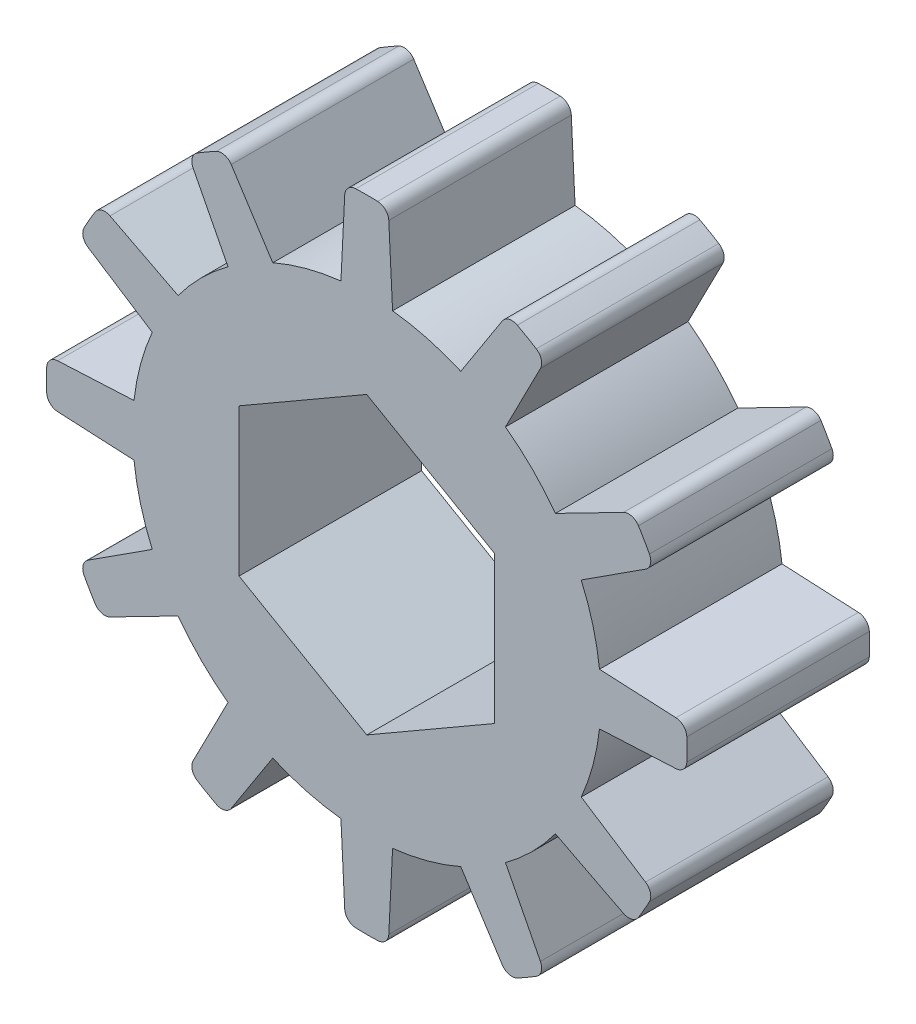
ISO-10303-21;
HEADER;
FILE_DESCRIPTION(('STEP AP214'),'2;1');
FILE_NAME('part.step','',(''),(''),'','','');
FILE_SCHEMA(('AUTOMOTIVE_DESIGN { 1 0 10303 214 1 1 1 1 }'));
ENDSEC;
DATA;
#1=APPLICATION_CONTEXT('core data for automotive mechanical design processes');
#2=APPLICATION_PROTOCOL_DEFINITION('international standard','automotive_design',2000,#1);
#3=PRODUCT_CONTEXT('',#1,'mechanical');
#4=PRODUCT('Part','Part','',(#3));
#5=PRODUCT_RELATED_PRODUCT_CATEGORY('part','',(#4));
#6=PRODUCT_DEFINITION_FORMATION('','',#4);
#7=PRODUCT_DEFINITION_CONTEXT('part definition',#1,'design');
#8=PRODUCT_DEFINITION('design','',#6,#7);
#9=PRODUCT_DEFINITION_SHAPE('','',#8);
#10=(LENGTH_UNIT() NAMED_UNIT(*) SI_UNIT(.MILLI.,.METRE.));
#11=(NAMED_UNIT(*) PLANE_ANGLE_UNIT() SI_UNIT($,.RADIAN.));
#12=(NAMED_UNIT(*) SI_UNIT($,.STERADIAN.) SOLID_ANGLE_UNIT());
#13=UNCERTAINTY_MEASURE_WITH_UNIT(LENGTH_MEASURE(1.E-05),#10,'distance_accuracy_value','');
#14=(GEOMETRIC_REPRESENTATION_CONTEXT(3) GLOBAL_UNCERTAINTY_ASSIGNED_CONTEXT((#13)) GLOBAL_UNIT_ASSIGNED_CONTEXT((#10,
#11,#12)) REPRESENTATION_CONTEXT('',''));
#15=CARTESIAN_POINT('',(0.,0.,0.));
#16=DIRECTION('',(0.,0.,1.));
#17=DIRECTION('',(1.,0.,0.));
#18=AXIS2_PLACEMENT_3D('',#15,#16,#17);
#19=CARTESIAN_POINT('',(0.,0.,3.18));
#20=DIRECTION('',(0.,0.,1.));
#21=DIRECTION('',(1.,0.,0.));
#22=AXIS2_PLACEMENT_3D('',#19,#20,#21);
#23=PLANE('',#22);
#24=DIRECTION('',(-0.866025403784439,-0.5,0.));
#25=VECTOR('',#24,1.);
#26=CARTESIAN_POINT('',(2.225,-1.28460434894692,3.18));
#27=LINE('',#26,#25);
#28=CARTESIAN_POINT('',(2.225,-1.28460434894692,3.18));
#29=VERTEX_POINT('',#28);
#30=CARTESIAN_POINT('',(0.,-2.56920869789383,3.18));
#31=VERTEX_POINT('',#30);
#32=EDGE_CURVE('E528',#29,#31,#27,.T.);
#33=ORIENTED_EDGE('',*,*,#32,.T.);
#34=DIRECTION('',(-0.866025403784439,0.5,0.));
#35=VECTOR('',#34,1.);
#36=CARTESIAN_POINT('',(0.,-2.56920869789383,3.18));
#37=LINE('',#36,#35);
#38=CARTESIAN_POINT('',(-2.225,-1.28460434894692,3.18));
#39=VERTEX_POINT('',#38);
#40=EDGE_CURVE('E540',#31,#39,#37,.T.);
#41=ORIENTED_EDGE('',*,*,#40,.T.);
#42=DIRECTION('',(0.,1.,0.));
#43=VECTOR('',#42,1.);
#44=CARTESIAN_POINT('',(-2.225,-1.28460434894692,3.18));
#45=LINE('',#44,#43);
#46=CARTESIAN_POINT('',(-2.225,1.28460434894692,3.18));
#47=VERTEX_POINT('',#46);
#48=EDGE_CURVE('E544',#39,#47,#45,.T.);
#49=ORIENTED_EDGE('',*,*,#48,.T.);
#50=DIRECTION('',(0.866025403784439,0.5,0.));
#51=VECTOR('',#50,1.);
#52=CARTESIAN_POINT('',(-2.225,1.28460434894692,3.18));
#53=LINE('',#52,#51);
#54=CARTESIAN_POINT('',(0.,2.56920869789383,3.18));
#55=VERTEX_POINT('',#54);
#56=EDGE_CURVE('E555',#47,#55,#53,.T.);
#57=ORIENTED_EDGE('',*,*,#56,.T.);
#58=DIRECTION('',(0.866025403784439,-0.5,0.));
#59=VECTOR('',#58,1.);
#60=CARTESIAN_POINT('',(0.,2.56920869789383,3.18));
#61=LINE('',#60,#59);
#62=CARTESIAN_POINT('',(2.225,1.28460434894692,3.18));
#63=VERTEX_POINT('',#62);
#64=EDGE_CURVE('E558',#55,#63,#61,.T.);
#65=ORIENTED_EDGE('',*,*,#64,.T.);
#66=DIRECTION('',(0.,-1.,0.));
#67=VECTOR('',#66,1.);
#68=CARTESIAN_POINT('',(2.225,1.28460434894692,3.18));
#69=LINE('',#68,#67);
#70=EDGE_CURVE('E536',#63,#29,#69,.T.);
#71=ORIENTED_EDGE('',*,*,#70,.T.);
#72=EDGE_LOOP('',(#33,#41,#49,#57,#65,#71));
#73=FACE_BOUND('',#72,.T.);
#74=DIRECTION('',(0.99877247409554,0.0495332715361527,0.));
#75=VECTOR('',#74,1.);
#76=CARTESIAN_POINT('',(5.56787554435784,-0.375,3.18));
#77=LINE('',#76,#75);
#78=CARTESIAN_POINT('',(4.0556003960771,-0.45,3.18));
#79=VERTEX_POINT('',#78);
#80=CARTESIAN_POINT('',(5.38724207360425,-0.383958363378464,3.18));
#81=VERTEX_POINT('',#80);
#82=EDGE_CURVE('E670',#79,#81,#77,.T.);
#83=ORIENTED_EDGE('',*,*,#82,.T.);
#84=CARTESIAN_POINT('',(5.37733541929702,-0.184203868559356,3.18));
#85=DIRECTION('',(0.,0.,1.));
#86=DIRECTION('',(1.,0.,0.));
#87=AXIS2_PLACEMENT_3D('',#84,#85,#86);
#88=CIRCLE('',#87,0.2);
#89=CARTESIAN_POINT('',(5.57721817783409,-0.191050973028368,3.18));
#90=VERTEX_POINT('',#89);
#91=EDGE_CURVE('E990',#81,#90,#88,.T.);
#92=ORIENTED_EDGE('',*,*,#91,.T.);
#93=CARTESIAN_POINT('',(0.,0.,3.18));
#94=DIRECTION('',(0.,0.,1.));
#95=DIRECTION('',(1.,0.,0.));
#96=AXIS2_PLACEMENT_3D('',#93,#94,#95);
#97=CIRCLE('',#96,5.58048950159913);
#98=CARTESIAN_POINT('',(5.57721817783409,0.191050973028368,3.18));
#99=VERTEX_POINT('',#98);
#100=EDGE_CURVE('E673',#90,#99,#97,.T.);
#101=ORIENTED_EDGE('',*,*,#100,.T.);
#102=CARTESIAN_POINT('',(5.37733541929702,0.184203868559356,3.18));
#103=DIRECTION('',(0.,0.,1.));
#104=DIRECTION('',(1.,0.,0.));
#105=AXIS2_PLACEMENT_3D('',#102,#103,#104);
#106=CIRCLE('',#105,0.2);
#107=CARTESIAN_POINT('',(5.38724207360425,0.383958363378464,3.18));
#108=VERTEX_POINT('',#107);
#109=EDGE_CURVE('E956',#99,#108,#106,.T.);
#110=ORIENTED_EDGE('',*,*,#109,.T.);
#111=DIRECTION('',(-0.99877247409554,0.0495332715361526,0.));
#112=VECTOR('',#111,1.);
#113=CARTESIAN_POINT('',(5.56787554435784,0.375,3.18));
#114=LINE('',#113,#112);
#115=CARTESIAN_POINT('',(4.0556003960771,0.45,3.18));
#116=VERTEX_POINT('',#115);
#117=EDGE_CURVE('E676',#108,#116,#114,.T.);
#118=ORIENTED_EDGE('',*,*,#117,.T.);
#119=CARTESIAN_POINT('',(0.,0.,3.18));
#120=DIRECTION('',(0.,0.,1.));
#121=DIRECTION('',(1.,0.,0.));
#122=AXIS2_PLACEMENT_3D('',#119,#120,#121);
#123=CIRCLE('',#122,4.08048950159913);
#124=CARTESIAN_POINT('',(3.737252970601,1.63808876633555,3.18));
#125=VERTEX_POINT('',#124);
#126=EDGE_CURVE('E678',#116,#125,#123,.T.);
#127=ORIENTED_EDGE('',*,*,#126,.T.);
#128=DIRECTION('',(0.840195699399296,0.542283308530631,0.));
#129=VECTOR('',#128,1.);
#130=CARTESIAN_POINT('',(5.009421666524,2.45917824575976,3.18));
#131=LINE('',#130,#129);
#132=CARTESIAN_POINT('',(4.85746767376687,2.36110334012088,3.18));
#133=VERTEX_POINT('',#132);
#134=EDGE_CURVE('E680',#125,#133,#131,.T.);
#135=ORIENTED_EDGE('',*,*,#134,.T.);
#136=CARTESIAN_POINT('',(4.74901101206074,2.52914248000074,3.18));
#137=DIRECTION('',(0.,0.,1.));
#138=DIRECTION('',(1.,0.,0.));
#139=AXIS2_PLACEMENT_3D('',#136,#137,#138);
#140=CIRCLE('',#139,0.2);
#141=CARTESIAN_POINT('',(4.92553811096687,2.62315409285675,3.18));
#142=VERTEX_POINT('',#141);
#143=EDGE_CURVE('E954',#133,#142,#140,.T.);
#144=ORIENTED_EDGE('',*,*,#143,.T.);
#145=CARTESIAN_POINT('',(0.,0.,3.18));
#146=DIRECTION('',(0.,0.,1.));
#147=DIRECTION('',(1.,0.,0.));
#148=AXIS2_PLACEMENT_3D('',#145,#146,#147);
#149=CIRCLE('',#148,5.58048950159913);
#150=CARTESIAN_POINT('',(4.7344871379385,2.95406408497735,3.18));
#151=VERTEX_POINT('',#150);
#152=EDGE_CURVE('E683',#142,#151,#149,.T.);
#153=ORIENTED_EDGE('',*,*,#152,.T.);
#154=CARTESIAN_POINT('',(4.56480714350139,2.84819293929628,3.18));
#155=DIRECTION('',(0.,0.,1.));
#156=DIRECTION('',(1.,0.,0.));
#157=AXIS2_PLACEMENT_3D('',#154,#155,#156);
#158=CIRCLE('',#157,0.2);
#159=CARTESIAN_POINT('',(4.4735093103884,3.02613873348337,3.18));
#160=VERTEX_POINT('',#159);
#161=EDGE_CURVE('E952',#151,#160,#158,.T.);
#162=ORIENTED_EDGE('',*,*,#161,.T.);
#163=DIRECTION('',(-0.889728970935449,-0.456489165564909,0.));
#164=VECTOR('',#163,1.);
#165=CARTESIAN_POINT('',(4.634421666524,3.10869729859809,3.18));
#166=LINE('',#165,#164);
#167=CARTESIAN_POINT('',(3.287252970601,2.41751162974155,3.18));
#168=VERTEX_POINT('',#167);
#169=EDGE_CURVE('E686',#160,#168,#166,.T.);
#170=ORIENTED_EDGE('',*,*,#169,.T.);
#171=CARTESIAN_POINT('',(0.,0.,3.18));
#172=DIRECTION('',(0.,0.,1.));
#173=DIRECTION('',(1.,0.,0.));
#174=AXIS2_PLACEMENT_3D('',#171,#172,#173);
#175=CIRCLE('',#174,4.08048950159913);
#176=CARTESIAN_POINT('',(2.41751162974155,3.287252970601,3.18));
#177=VERTEX_POINT('',#176);
#178=EDGE_CURVE('E688',#168,#177,#175,.T.);
#179=ORIENTED_EDGE('',*,*,#178,.T.);
#180=DIRECTION('',(0.456489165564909,0.889728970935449,0.));
#181=VECTOR('',#180,1.);
#182=CARTESIAN_POINT('',(3.10869729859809,4.634421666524,3.18));
#183=LINE('',#182,#181);
#184=CARTESIAN_POINT('',(3.02613873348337,4.47350931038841,3.18));
#185=VERTEX_POINT('',#184);
#186=EDGE_CURVE('E690',#177,#185,#183,.T.);
#187=ORIENTED_EDGE('',*,*,#186,.T.);
#188=CARTESIAN_POINT('',(2.84819293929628,4.56480714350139,3.18));
#189=DIRECTION('',(0.,0.,1.));
#190=DIRECTION('',(1.,0.,0.));
#191=AXIS2_PLACEMENT_3D('',#188,#189,#190);
#192=CIRCLE('',#191,0.2);
#193=CARTESIAN_POINT('',(2.95406408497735,4.7344871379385,3.18));
#194=VERTEX_POINT('',#193);
#195=EDGE_CURVE('E950',#185,#194,#192,.T.);
#196=ORIENTED_EDGE('',*,*,#195,.T.);
#197=CARTESIAN_POINT('',(0.,0.,3.18));
#198=DIRECTION('',(0.,0.,1.));
#199=DIRECTION('',(1.,0.,0.));
#200=AXIS2_PLACEMENT_3D('',#197,#198,#199);
#201=CIRCLE('',#200,5.58048950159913);
#202=CARTESIAN_POINT('',(2.62315409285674,4.92553811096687,3.18));
#203=VERTEX_POINT('',#202);
#204=EDGE_CURVE('E693',#194,#203,#201,.T.);
#205=ORIENTED_EDGE('',*,*,#204,.T.);
#206=CARTESIAN_POINT('',(2.52914248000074,4.74901101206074,3.18));
#207=DIRECTION('',(0.,0.,1.));
#208=DIRECTION('',(1.,0.,0.));
#209=AXIS2_PLACEMENT_3D('',#206,#207,#208);
#210=CIRCLE('',#209,0.2);
#211=CARTESIAN_POINT('',(2.36110334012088,4.85746767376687,3.18));
#212=VERTEX_POINT('',#211);
#213=EDGE_CURVE('E59',#203,#212,#210,.T.);
#214=ORIENTED_EDGE('',*,*,#213,.T.);
#215=DIRECTION('',(-0.54228330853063,-0.840195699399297,0.));
#216=VECTOR('',#215,1.);
#217=CARTESIAN_POINT('',(2.45917824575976,5.009421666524,3.18));
#218=LINE('',#217,#216);
#219=CARTESIAN_POINT('',(1.63808876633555,3.737252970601,3.18));
#220=VERTEX_POINT('',#219);
#221=EDGE_CURVE('E695',#212,#220,#218,.T.);
#222=ORIENTED_EDGE('',*,*,#221,.T.);
#223=CARTESIAN_POINT('',(0.,0.,3.18));
#224=DIRECTION('',(0.,0.,1.));
#225=DIRECTION('',(1.,0.,0.));
#226=AXIS2_PLACEMENT_3D('',#223,#224,#225);
#227=CIRCLE('',#226,4.08048950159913);
#228=CARTESIAN_POINT('',(0.45,4.0556003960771,3.18));
#229=VERTEX_POINT('',#228);
#230=EDGE_CURVE('E697',#220,#229,#227,.T.);
#231=ORIENTED_EDGE('',*,*,#230,.T.);
#232=DIRECTION('',(-0.0495332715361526,0.99877247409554,0.));
#233=VECTOR('',#232,1.);
#234=CARTESIAN_POINT('',(0.375,5.56787554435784,3.18));
#235=LINE('',#234,#233);
#236=CARTESIAN_POINT('',(0.383958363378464,5.38724207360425,3.18));
#237=VERTEX_POINT('',#236);
#238=EDGE_CURVE('E699',#229,#237,#235,.T.);
#239=ORIENTED_EDGE('',*,*,#238,.T.);
#240=CARTESIAN_POINT('',(0.184203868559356,5.37733541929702,3.18));
#241=DIRECTION('',(0.,0.,1.));
#242=DIRECTION('',(1.,0.,0.));
#243=AXIS2_PLACEMENT_3D('',#240,#241,#242);
#244=CIRCLE('',#243,0.2);
#245=CARTESIAN_POINT('',(0.191050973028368,5.57721817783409,3.18));
#246=VERTEX_POINT('',#245);
#247=EDGE_CURVE('E947',#237,#246,#244,.T.);
#248=ORIENTED_EDGE('',*,*,#247,.T.);
#249=CARTESIAN_POINT('',(0.,0.,3.18));
#250=DIRECTION('',(0.,0.,1.));
#251=DIRECTION('',(1.,0.,0.));
#252=AXIS2_PLACEMENT_3D('',#249,#250,#251);
#253=CIRCLE('',#252,5.58048950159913);
#254=CARTESIAN_POINT('',(-0.191050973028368,5.57721817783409,3.18));
#255=VERTEX_POINT('',#254);
#256=EDGE_CURVE('E582',#246,#255,#253,.T.);
#257=ORIENTED_EDGE('',*,*,#256,.T.);
#258=CARTESIAN_POINT('',(-0.184203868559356,5.37733541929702,3.18));
#259=DIRECTION('',(0.,0.,1.));
#260=DIRECTION('',(1.,0.,0.));
#261=AXIS2_PLACEMENT_3D('',#258,#259,#260);
#262=CIRCLE('',#261,0.2);
#263=CARTESIAN_POINT('',(-0.383958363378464,5.38724207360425,3.18));
#264=VERTEX_POINT('',#263);
#265=EDGE_CURVE('E945',#255,#264,#262,.T.);
#266=ORIENTED_EDGE('',*,*,#265,.T.);
#267=DIRECTION('',(-0.0495332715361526,-0.99877247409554,0.));
#268=VECTOR('',#267,1.);
#269=CARTESIAN_POINT('',(-0.375,5.56787554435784,3.18));
#270=LINE('',#269,#268);
#271=CARTESIAN_POINT('',(-0.45,4.0556003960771,3.18));
#272=VERTEX_POINT('',#271);
#273=EDGE_CURVE('E585',#264,#272,#270,.T.);
#274=ORIENTED_EDGE('',*,*,#273,.T.);
#275=CARTESIAN_POINT('',(0.,0.,3.18));
#276=DIRECTION('',(0.,0.,1.));
#277=DIRECTION('',(1.,0.,0.));
#278=AXIS2_PLACEMENT_3D('',#275,#276,#277);
#279=CIRCLE('',#278,4.08048950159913);
#280=CARTESIAN_POINT('',(-1.63808876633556,3.737252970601,3.18));
#281=VERTEX_POINT('',#280);
#282=EDGE_CURVE('E588',#272,#281,#279,.T.);
#283=ORIENTED_EDGE('',*,*,#282,.T.);
#284=DIRECTION('',(-0.542283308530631,0.840195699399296,0.));
#285=VECTOR('',#284,1.);
#286=CARTESIAN_POINT('',(-2.45917824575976,5.009421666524,3.18));
#287=LINE('',#286,#285);
#288=CARTESIAN_POINT('',(-2.36110334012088,4.85746767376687,3.18));
#289=VERTEX_POINT('',#288);
#290=EDGE_CURVE('E590',#281,#289,#287,.T.);
#291=ORIENTED_EDGE('',*,*,#290,.T.);
#292=CARTESIAN_POINT('',(-2.52914248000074,4.74901101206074,3.18));
#293=DIRECTION('',(0.,0.,1.));
#294=DIRECTION('',(1.,0.,0.));
#295=AXIS2_PLACEMENT_3D('',#292,#293,#294);
#296=CIRCLE('',#295,0.2);
#297=CARTESIAN_POINT('',(-2.62315409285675,4.92553811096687,3.18));
#298=VERTEX_POINT('',#297);
#299=EDGE_CURVE('E958',#289,#298,#296,.T.);
#300=ORIENTED_EDGE('',*,*,#299,.T.);
#301=CARTESIAN_POINT('',(0.,0.,3.18));
#302=DIRECTION('',(0.,0.,1.));
#303=DIRECTION('',(1.,0.,0.));
#304=AXIS2_PLACEMENT_3D('',#301,#302,#303);
#305=CIRCLE('',#304,5.58048950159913);
#306=CARTESIAN_POINT('',(-2.95406408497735,4.7344871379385,3.18));
#307=VERTEX_POINT('',#306);
#308=EDGE_CURVE('E593',#298,#307,#305,.T.);
#309=ORIENTED_EDGE('',*,*,#308,.T.);
#310=CARTESIAN_POINT('',(-2.84819293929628,4.56480714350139,3.18));
#311=DIRECTION('',(0.,0.,1.));
#312=DIRECTION('',(1.,0.,0.));
#313=AXIS2_PLACEMENT_3D('',#310,#311,#312);
#314=CIRCLE('',#313,0.2);
#315=CARTESIAN_POINT('',(-3.02613873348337,4.4735093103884,3.18));
#316=VERTEX_POINT('',#315);
#317=EDGE_CURVE('E960',#307,#316,#314,.T.);
#318=ORIENTED_EDGE('',*,*,#317,.T.);
#319=DIRECTION('',(0.456489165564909,-0.889728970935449,0.));
#320=VECTOR('',#319,1.);
#321=CARTESIAN_POINT('',(-3.10869729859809,4.634421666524,3.18));
#322=LINE('',#321,#320);
#323=CARTESIAN_POINT('',(-2.41751162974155,3.287252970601,3.18));
#324=VERTEX_POINT('',#323);
#325=EDGE_CURVE('E596',#316,#324,#322,.T.);
#326=ORIENTED_EDGE('',*,*,#325,.T.);
#327=CARTESIAN_POINT('',(0.,0.,3.18));
#328=DIRECTION('',(0.,0.,1.));
#329=DIRECTION('',(1.,0.,0.));
#330=AXIS2_PLACEMENT_3D('',#327,#328,#329);
#331=CIRCLE('',#330,4.08048950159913);
#332=CARTESIAN_POINT('',(-3.287252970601,2.41751162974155,3.18));
#333=VERTEX_POINT('',#332);
#334=EDGE_CURVE('E598',#324,#333,#331,.T.);
#335=ORIENTED_EDGE('',*,*,#334,.T.);
#336=DIRECTION('',(-0.889728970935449,0.456489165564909,0.));
#337=VECTOR('',#336,1.);
#338=CARTESIAN_POINT('',(-4.634421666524,3.10869729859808,3.18));
#339=LINE('',#338,#337);
#340=CARTESIAN_POINT('',(-4.47350931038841,3.02613873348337,3.18));
#341=VERTEX_POINT('',#340);
#342=EDGE_CURVE('E600',#333,#341,#339,.T.);
#343=ORIENTED_EDGE('',*,*,#342,.T.);
#344=CARTESIAN_POINT('',(-4.56480714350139,2.84819293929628,3.18));
#345=DIRECTION('',(0.,0.,1.));
#346=DIRECTION('',(1.,0.,0.));
#347=AXIS2_PLACEMENT_3D('',#344,#345,#346);
#348=CIRCLE('',#347,0.2);
#349=CARTESIAN_POINT('',(-4.7344871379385,2.95406408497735,3.18));
#350=VERTEX_POINT('',#349);
#351=EDGE_CURVE('E962',#341,#350,#348,.T.);
#352=ORIENTED_EDGE('',*,*,#351,.T.);
#353=CARTESIAN_POINT('',(0.,0.,3.18));
#354=DIRECTION('',(0.,0.,1.));
#355=DIRECTION('',(1.,0.,0.));
#356=AXIS2_PLACEMENT_3D('',#353,#354,#355);
#357=CIRCLE('',#356,5.58048950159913);
#358=CARTESIAN_POINT('',(-4.92553811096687,2.62315409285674,3.18));
#359=VERTEX_POINT('',#358);
#360=EDGE_CURVE('E603',#350,#359,#357,.T.);
#361=ORIENTED_EDGE('',*,*,#360,.T.);
#362=CARTESIAN_POINT('',(-4.74901101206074,2.52914248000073,3.18));
#363=DIRECTION('',(0.,0.,1.));
#364=DIRECTION('',(1.,0.,0.));
#365=AXIS2_PLACEMENT_3D('',#362,#363,#364);
#366=CIRCLE('',#365,0.2);
#367=CARTESIAN_POINT('',(-4.85746767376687,2.36110334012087,3.18));
#368=VERTEX_POINT('',#367);
#369=EDGE_CURVE('E964',#359,#368,#366,.T.);
#370=ORIENTED_EDGE('',*,*,#369,.T.);
#371=DIRECTION('',(0.840195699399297,-0.54228330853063,0.));
#372=VECTOR('',#371,1.);
#373=CARTESIAN_POINT('',(-5.009421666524,2.45917824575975,3.18));
#374=LINE('',#373,#372);
#375=CARTESIAN_POINT('',(-3.737252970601,1.63808876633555,3.18));
#376=VERTEX_POINT('',#375);
#377=EDGE_CURVE('E606',#368,#376,#374,.T.);
#378=ORIENTED_EDGE('',*,*,#377,.T.);
#379=CARTESIAN_POINT('',(0.,0.,3.18));
#380=DIRECTION('',(0.,0.,1.));
#381=DIRECTION('',(1.,0.,0.));
#382=AXIS2_PLACEMENT_3D('',#379,#380,#381);
#383=CIRCLE('',#382,4.08048950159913);
#384=CARTESIAN_POINT('',(-4.0556003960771,0.449999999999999,3.18));
#385=VERTEX_POINT('',#384);
#386=EDGE_CURVE('E608',#376,#385,#383,.T.);
#387=ORIENTED_EDGE('',*,*,#386,.T.);
#388=DIRECTION('',(-0.99877247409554,-0.0495332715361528,0.));
#389=VECTOR('',#388,1.);
#390=CARTESIAN_POINT('',(-5.56787554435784,0.374999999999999,3.18));
#391=LINE('',#390,#389);
#392=CARTESIAN_POINT('',(-5.38724207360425,0.383958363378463,3.18));
#393=VERTEX_POINT('',#392);
#394=EDGE_CURVE('E610',#385,#393,#391,.T.);
#395=ORIENTED_EDGE('',*,*,#394,.T.);
#396=CARTESIAN_POINT('',(-5.37733541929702,0.184203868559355,3.18));
#397=DIRECTION('',(0.,0.,1.));
#398=DIRECTION('',(1.,0.,0.));
#399=AXIS2_PLACEMENT_3D('',#396,#397,#398);
#400=CIRCLE('',#399,0.2);
#401=CARTESIAN_POINT('',(-5.57721817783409,0.191050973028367,3.18));
#402=VERTEX_POINT('',#401);
#403=EDGE_CURVE('E966',#393,#402,#400,.T.);
#404=ORIENTED_EDGE('',*,*,#403,.T.);
#405=CARTESIAN_POINT('',(0.,0.,3.18));
#406=DIRECTION('',(0.,0.,1.));
#407=DIRECTION('',(1.,0.,0.));
#408=AXIS2_PLACEMENT_3D('',#405,#406,#407);
#409=CIRCLE('',#408,5.58048950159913);
#410=CARTESIAN_POINT('',(-5.57721817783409,-0.191050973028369,3.18));
#411=VERTEX_POINT('',#410);
#412=EDGE_CURVE('E613',#402,#411,#409,.T.);
#413=ORIENTED_EDGE('',*,*,#412,.T.);
#414=CARTESIAN_POINT('',(-5.37733541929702,-0.184203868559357,3.18));
#415=DIRECTION('',(0.,0.,1.));
#416=DIRECTION('',(1.,0.,0.));
#417=AXIS2_PLACEMENT_3D('',#414,#415,#416);
#418=CIRCLE('',#417,0.2);
#419=CARTESIAN_POINT('',(-5.38724207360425,-0.383958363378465,3.18));
#420=VERTEX_POINT('',#419);
#421=EDGE_CURVE('E968',#411,#420,#418,.T.);
#422=ORIENTED_EDGE('',*,*,#421,.T.);
#423=DIRECTION('',(0.99877247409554,-0.0495332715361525,0.));
#424=VECTOR('',#423,1.);
#425=CARTESIAN_POINT('',(-5.56787554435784,-0.375000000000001,3.18));
#426=LINE('',#425,#424);
#427=CARTESIAN_POINT('',(-4.0556003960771,-0.449999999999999,3.18));
#428=VERTEX_POINT('',#427);
#429=EDGE_CURVE('E616',#420,#428,#426,.T.);
#430=ORIENTED_EDGE('',*,*,#429,.T.);
#431=CARTESIAN_POINT('',(0.,0.,3.18));
#432=DIRECTION('',(0.,0.,1.));
#433=DIRECTION('',(1.,0.,0.));
#434=AXIS2_PLACEMENT_3D('',#431,#432,#433);
#435=CIRCLE('',#434,4.08048950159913);
#436=CARTESIAN_POINT('',(-3.737252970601,-1.63808876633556,3.18));
#437=VERTEX_POINT('',#436);
#438=EDGE_CURVE('E618',#428,#437,#435,.T.);
#439=ORIENTED_EDGE('',*,*,#438,.T.);
#440=DIRECTION('',(-0.840195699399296,-0.542283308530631,0.));
#441=VECTOR('',#440,1.);
#442=CARTESIAN_POINT('',(-5.009421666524,-2.45917824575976,3.18));
#443=LINE('',#442,#441);
#444=CARTESIAN_POINT('',(-4.85746767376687,-2.36110334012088,3.18));
#445=VERTEX_POINT('',#444);
#446=EDGE_CURVE('E620',#437,#445,#443,.T.);
#447=ORIENTED_EDGE('',*,*,#446,.T.);
#448=CARTESIAN_POINT('',(-4.74901101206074,-2.52914248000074,3.18));
#449=DIRECTION('',(0.,0.,1.));
#450=DIRECTION('',(1.,0.,0.));
#451=AXIS2_PLACEMENT_3D('',#448,#449,#450);
#452=CIRCLE('',#451,0.2);
#453=CARTESIAN_POINT('',(-4.92553811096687,-2.62315409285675,3.18));
#454=VERTEX_POINT('',#453);
#455=EDGE_CURVE('E970',#445,#454,#452,.T.);
#456=ORIENTED_EDGE('',*,*,#455,.T.);
#457=CARTESIAN_POINT('',(0.,0.,3.18));
#458=DIRECTION('',(0.,0.,1.));
#459=DIRECTION('',(1.,0.,0.));
#460=AXIS2_PLACEMENT_3D('',#457,#458,#459);
#461=CIRCLE('',#460,5.58048950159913);
#462=CARTESIAN_POINT('',(-4.7344871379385,-2.95406408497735,3.18));
#463=VERTEX_POINT('',#462);
#464=EDGE_CURVE('E623',#454,#463,#461,.T.);
#465=ORIENTED_EDGE('',*,*,#464,.T.);
#466=CARTESIAN_POINT('',(-4.56480714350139,-2.84819293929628,3.18));
#467=DIRECTION('',(0.,0.,1.));
#468=DIRECTION('',(1.,0.,0.));
#469=AXIS2_PLACEMENT_3D('',#466,#467,#468);
#470=CIRCLE('',#469,0.2);
#471=CARTESIAN_POINT('',(-4.4735093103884,-3.02613873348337,3.18));
#472=VERTEX_POINT('',#471);
#473=EDGE_CURVE('E972',#463,#472,#470,.T.);
#474=ORIENTED_EDGE('',*,*,#473,.T.);
#475=DIRECTION('',(0.889728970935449,0.456489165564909,0.));
#476=VECTOR('',#475,1.);
#477=CARTESIAN_POINT('',(-4.634421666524,-3.10869729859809,3.18));
#478=LINE('',#477,#476);
#479=CARTESIAN_POINT('',(-3.287252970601,-2.41751162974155,3.18));
#480=VERTEX_POINT('',#479);
#481=EDGE_CURVE('E626',#472,#480,#478,.T.);
#482=ORIENTED_EDGE('',*,*,#481,.T.);
#483=CARTESIAN_POINT('',(0.,0.,3.18));
#484=DIRECTION('',(0.,0.,1.));
#485=DIRECTION('',(1.,0.,0.));
#486=AXIS2_PLACEMENT_3D('',#483,#484,#485);
#487=CIRCLE('',#486,4.08048950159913);
#488=CARTESIAN_POINT('',(-2.41751162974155,-3.287252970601,3.18));
#489=VERTEX_POINT('',#488);
#490=EDGE_CURVE('E628',#480,#489,#487,.T.);
#491=ORIENTED_EDGE('',*,*,#490,.T.);
#492=DIRECTION('',(-0.456489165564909,-0.889728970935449,0.));
#493=VECTOR('',#492,1.);
#494=CARTESIAN_POINT('',(-3.10869729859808,-4.634421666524,3.18));
#495=LINE('',#494,#493);
#496=CARTESIAN_POINT('',(-3.02613873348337,-4.47350931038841,3.18));
#497=VERTEX_POINT('',#496);
#498=EDGE_CURVE('E630',#489,#497,#495,.T.);
#499=ORIENTED_EDGE('',*,*,#498,.T.);
#500=CARTESIAN_POINT('',(-2.84819293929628,-4.56480714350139,3.18));
#501=DIRECTION('',(0.,0.,1.));
#502=DIRECTION('',(1.,0.,0.));
#503=AXIS2_PLACEMENT_3D('',#500,#501,#502);
#504=CIRCLE('',#503,0.2);
#505=CARTESIAN_POINT('',(-2.95406408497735,-4.7344871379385,3.18));
#506=VERTEX_POINT('',#505);
#507=EDGE_CURVE('E986',#497,#506,#504,.T.);
#508=ORIENTED_EDGE('',*,*,#507,.T.);
#509=CARTESIAN_POINT('',(0.,0.,3.18));
#510=DIRECTION('',(0.,0.,1.));
#511=DIRECTION('',(1.,0.,0.));
#512=AXIS2_PLACEMENT_3D('',#509,#510,#511);
#513=CIRCLE('',#512,5.58048950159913);
#514=CARTESIAN_POINT('',(-2.62315409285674,-4.92553811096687,3.18));
#515=VERTEX_POINT('',#514);
#516=EDGE_CURVE('E633',#506,#515,#513,.T.);
#517=ORIENTED_EDGE('',*,*,#516,.T.);
#518=CARTESIAN_POINT('',(-2.52914248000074,-4.74901101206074,3.18));
#519=DIRECTION('',(0.,0.,1.));
#520=DIRECTION('',(1.,0.,0.));
#521=AXIS2_PLACEMENT_3D('',#518,#519,#520);
#522=CIRCLE('',#521,0.2);
#523=CARTESIAN_POINT('',(-2.36110334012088,-4.85746767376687,3.18));
#524=VERTEX_POINT('',#523);
#525=EDGE_CURVE('E988',#515,#524,#522,.T.);
#526=ORIENTED_EDGE('',*,*,#525,.T.);
#527=DIRECTION('',(0.542283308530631,0.840195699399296,0.));
#528=VECTOR('',#527,1.);
#529=CARTESIAN_POINT('',(-2.45917824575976,-5.009421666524,3.18));
#530=LINE('',#529,#528);
#531=CARTESIAN_POINT('',(-1.63808876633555,-3.737252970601,3.18));
#532=VERTEX_POINT('',#531);
#533=EDGE_CURVE('E636',#524,#532,#530,.T.);
#534=ORIENTED_EDGE('',*,*,#533,.T.);
#535=CARTESIAN_POINT('',(0.,0.,3.18));
#536=DIRECTION('',(0.,0.,1.));
#537=DIRECTION('',(1.,0.,0.));
#538=AXIS2_PLACEMENT_3D('',#535,#536,#537);
#539=CIRCLE('',#538,4.08048950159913);
#540=CARTESIAN_POINT('',(-0.45,-4.0556003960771,3.18));
#541=VERTEX_POINT('',#540);
#542=EDGE_CURVE('E638',#532,#541,#539,.T.);
#543=ORIENTED_EDGE('',*,*,#542,.T.);
#544=DIRECTION('',(0.0495332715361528,-0.99877247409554,0.));
#545=VECTOR('',#544,1.);
#546=CARTESIAN_POINT('',(-0.374999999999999,-5.56787554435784,3.18));
#547=LINE('',#546,#545);
#548=CARTESIAN_POINT('',(-0.383958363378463,-5.38724207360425,3.18));
#549=VERTEX_POINT('',#548);
#550=EDGE_CURVE('E640',#541,#549,#547,.T.);
#551=ORIENTED_EDGE('',*,*,#550,.T.);
#552=CARTESIAN_POINT('',(-0.184203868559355,-5.37733541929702,3.18));
#553=DIRECTION('',(0.,0.,1.));
#554=DIRECTION('',(1.,0.,0.));
#555=AXIS2_PLACEMENT_3D('',#552,#553,#554);
#556=CIRCLE('',#555,0.2);
#557=CARTESIAN_POINT('',(-0.191050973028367,-5.57721817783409,3.18));
#558=VERTEX_POINT('',#557);
#559=EDGE_CURVE('E982',#549,#558,#556,.T.);
#560=ORIENTED_EDGE('',*,*,#559,.T.);
#561=CARTESIAN_POINT('',(0.,0.,3.18));
#562=DIRECTION('',(0.,0.,1.));
#563=DIRECTION('',(1.,0.,0.));
#564=AXIS2_PLACEMENT_3D('',#561,#562,#563);
#565=CIRCLE('',#564,5.58048950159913);
#566=CARTESIAN_POINT('',(0.191050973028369,-5.57721817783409,3.18));
#567=VERTEX_POINT('',#566);
#568=EDGE_CURVE('E643',#558,#567,#565,.T.);
#569=ORIENTED_EDGE('',*,*,#568,.T.);
#570=CARTESIAN_POINT('',(0.184203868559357,-5.37733541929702,3.18));
#571=DIRECTION('',(0.,0.,1.));
#572=DIRECTION('',(1.,0.,0.));
#573=AXIS2_PLACEMENT_3D('',#570,#571,#572);
#574=CIRCLE('',#573,0.2);
#575=CARTESIAN_POINT('',(0.383958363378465,-5.38724207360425,3.18));
#576=VERTEX_POINT('',#575);
#577=EDGE_CURVE('E984',#567,#576,#574,.T.);
#578=ORIENTED_EDGE('',*,*,#577,.T.);
#579=DIRECTION('',(0.0495332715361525,0.99877247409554,0.));
#580=VECTOR('',#579,1.);
#581=CARTESIAN_POINT('',(0.375000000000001,-5.56787554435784,3.18));
#582=LINE('',#581,#580);
#583=CARTESIAN_POINT('',(0.449999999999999,-4.0556003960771,3.18));
#584=VERTEX_POINT('',#583);
#585=EDGE_CURVE('E646',#576,#584,#582,.T.);
#586=ORIENTED_EDGE('',*,*,#585,.T.);
#587=CARTESIAN_POINT('',(0.,0.,3.18));
#588=DIRECTION('',(0.,0.,1.));
#589=DIRECTION('',(1.,0.,0.));
#590=AXIS2_PLACEMENT_3D('',#587,#588,#589);
#591=CIRCLE('',#590,4.08048950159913);
#592=CARTESIAN_POINT('',(1.63808876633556,-3.737252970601,3.18));
#593=VERTEX_POINT('',#592);
#594=EDGE_CURVE('E648',#584,#593,#591,.T.);
#595=ORIENTED_EDGE('',*,*,#594,.T.);
#596=DIRECTION('',(0.542283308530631,-0.840195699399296,0.));
#597=VECTOR('',#596,1.);
#598=CARTESIAN_POINT('',(2.45917824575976,-5.009421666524,3.18));
#599=LINE('',#598,#597);
#600=CARTESIAN_POINT('',(2.36110334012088,-4.85746767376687,3.18));
#601=VERTEX_POINT('',#600);
#602=EDGE_CURVE('E650',#593,#601,#599,.T.);
#603=ORIENTED_EDGE('',*,*,#602,.T.);
#604=CARTESIAN_POINT('',(2.52914248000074,-4.74901101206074,3.18));
#605=DIRECTION('',(0.,0.,1.));
#606=DIRECTION('',(1.,0.,0.));
#607=AXIS2_PLACEMENT_3D('',#604,#605,#606);
#608=CIRCLE('',#607,0.2);
#609=CARTESIAN_POINT('',(2.62315409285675,-4.92553811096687,3.18));
#610=VERTEX_POINT('',#609);
#611=EDGE_CURVE('E978',#601,#610,#608,.T.);
#612=ORIENTED_EDGE('',*,*,#611,.T.);
#613=CARTESIAN_POINT('',(0.,0.,3.18));
#614=DIRECTION('',(0.,0.,1.));
#615=DIRECTION('',(1.,0.,0.));
#616=AXIS2_PLACEMENT_3D('',#613,#614,#615);
#617=CIRCLE('',#616,5.58048950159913);
#618=CARTESIAN_POINT('',(2.95406408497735,-4.7344871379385,3.18));
#619=VERTEX_POINT('',#618);
#620=EDGE_CURVE('E653',#610,#619,#617,.T.);
#621=ORIENTED_EDGE('',*,*,#620,.T.);
#622=CARTESIAN_POINT('',(2.84819293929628,-4.56480714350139,3.18));
#623=DIRECTION('',(0.,0.,1.));
#624=DIRECTION('',(1.,0.,0.));
#625=AXIS2_PLACEMENT_3D('',#622,#623,#624);
#626=CIRCLE('',#625,0.2);
#627=CARTESIAN_POINT('',(3.02613873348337,-4.4735093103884,3.18));
#628=VERTEX_POINT('',#627);
#629=EDGE_CURVE('E980',#619,#628,#626,.T.);
#630=ORIENTED_EDGE('',*,*,#629,.T.);
#631=DIRECTION('',(-0.456489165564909,0.889728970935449,0.));
#632=VECTOR('',#631,1.);
#633=CARTESIAN_POINT('',(3.10869729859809,-4.634421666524,3.18));
#634=LINE('',#633,#632);
#635=CARTESIAN_POINT('',(2.41751162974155,-3.287252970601,3.18));
#636=VERTEX_POINT('',#635);
#637=EDGE_CURVE('E656',#628,#636,#634,.T.);
#638=ORIENTED_EDGE('',*,*,#637,.T.);
#639=CARTESIAN_POINT('',(0.,0.,3.18));
#640=DIRECTION('',(0.,0.,1.));
#641=DIRECTION('',(1.,0.,0.));
#642=AXIS2_PLACEMENT_3D('',#639,#640,#641);
#643=CIRCLE('',#642,4.08048950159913);
#644=CARTESIAN_POINT('',(3.287252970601,-2.41751162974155,3.18));
#645=VERTEX_POINT('',#644);
#646=EDGE_CURVE('E658',#636,#645,#643,.T.);
#647=ORIENTED_EDGE('',*,*,#646,.T.);
#648=DIRECTION('',(0.889728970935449,-0.456489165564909,0.));
#649=VECTOR('',#648,1.);
#650=CARTESIAN_POINT('',(4.634421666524,-3.10869729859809,3.18));
#651=LINE('',#650,#649);
#652=CARTESIAN_POINT('',(4.4735093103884,-3.02613873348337,3.18));
#653=VERTEX_POINT('',#652);
#654=EDGE_CURVE('E660',#645,#653,#651,.T.);
#655=ORIENTED_EDGE('',*,*,#654,.T.);
#656=CARTESIAN_POINT('',(4.56480714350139,-2.84819293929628,3.18));
#657=DIRECTION('',(0.,0.,1.));
#658=DIRECTION('',(1.,0.,0.));
#659=AXIS2_PLACEMENT_3D('',#656,#657,#658);
#660=CIRCLE('',#659,0.2);
#661=CARTESIAN_POINT('',(4.7344871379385,-2.95406408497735,3.18));
#662=VERTEX_POINT('',#661);
#663=EDGE_CURVE('E974',#653,#662,#660,.T.);
#664=ORIENTED_EDGE('',*,*,#663,.T.);
#665=CARTESIAN_POINT('',(0.,0.,3.18));
#666=DIRECTION('',(0.,0.,1.));
#667=DIRECTION('',(1.,0.,0.));
#668=AXIS2_PLACEMENT_3D('',#665,#666,#667);
#669=CIRCLE('',#668,5.58048950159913);
#670=CARTESIAN_POINT('',(4.92553811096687,-2.62315409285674,3.18));
#671=VERTEX_POINT('',#670);
#672=EDGE_CURVE('E663',#662,#671,#669,.T.);
#673=ORIENTED_EDGE('',*,*,#672,.T.);
#674=CARTESIAN_POINT('',(4.74901101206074,-2.52914248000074,3.18));
#675=DIRECTION('',(0.,0.,1.));
#676=DIRECTION('',(1.,0.,0.));
#677=AXIS2_PLACEMENT_3D('',#674,#675,#676);
#678=CIRCLE('',#677,0.2);
#679=CARTESIAN_POINT('',(4.85746767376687,-2.36110334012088,3.18));
#680=VERTEX_POINT('',#679);
#681=EDGE_CURVE('E976',#671,#680,#678,.T.);
#682=ORIENTED_EDGE('',*,*,#681,.T.);
#683=DIRECTION('',(-0.840195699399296,0.542283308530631,0.));
#684=VECTOR('',#683,1.);
#685=CARTESIAN_POINT('',(5.009421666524,-2.45917824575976,3.18));
#686=LINE('',#685,#684);
#687=CARTESIAN_POINT('',(3.737252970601,-1.63808876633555,3.18));
#688=VERTEX_POINT('',#687);
#689=EDGE_CURVE('E666',#680,#688,#686,.T.);
#690=ORIENTED_EDGE('',*,*,#689,.T.);
#691=CARTESIAN_POINT('',(0.,0.,3.18));
#692=DIRECTION('',(0.,0.,1.));
#693=DIRECTION('',(1.,0.,0.));
#694=AXIS2_PLACEMENT_3D('',#691,#692,#693);
#695=CIRCLE('',#694,4.08048950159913);
#696=EDGE_CURVE('E668',#688,#79,#695,.T.);
#697=ORIENTED_EDGE('',*,*,#696,.T.);
#698=EDGE_LOOP('',(#83,#92,#101,#110,#118,#127,#135,#144,#153,#162,#170,#179,#187,#196,#205,
#214,#222,#231,#239,#248,#257,#266,#274,#283,#291,#300,#309,#318,#326,#335,#343,#352,#361,#370,
#378,#387,#395,#404,#413,#422,#430,#439,#447,#456,#465,#474,#482,#491,#499,#508,#517,#526,#534,
#543,#551,#560,#569,#578,#586,#595,#603,#612,#621,#630,#638,#647,#655,#664,#673,#682,#690,#697));
#699=FACE_BOUND('',#698,.T.);
#700=ADVANCED_FACE('F37',(#73,#699),#23,.T.);
#701=CARTESIAN_POINT('',(0.,0.,0.));
#702=DIRECTION('',(0.,0.,1.));
#703=DIRECTION('',(1.,0.,0.));
#704=AXIS2_PLACEMENT_3D('',#701,#702,#703);
#705=PLANE('',#704);
#706=DIRECTION('',(-0.866025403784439,0.5,0.));
#707=VECTOR('',#706,1.);
#708=CARTESIAN_POINT('',(0.,-2.56920869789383,0.));
#709=LINE('',#708,#707);
#710=CARTESIAN_POINT('',(0.,-2.56920869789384,0.));
#711=VERTEX_POINT('',#710);
#712=CARTESIAN_POINT('',(-2.225,-1.28460434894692,0.));
#713=VERTEX_POINT('',#712);
#714=EDGE_CURVE('E562',#711,#713,#709,.T.);
#715=ORIENTED_EDGE('',*,*,#714,.F.);
#716=DIRECTION('',(-0.866025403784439,-0.5,0.));
#717=VECTOR('',#716,1.);
#718=CARTESIAN_POINT('',(2.225,-1.28460434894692,0.));
#719=LINE('',#718,#717);
#720=CARTESIAN_POINT('',(2.225,-1.28460434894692,0.));
#721=VERTEX_POINT('',#720);
#722=EDGE_CURVE('E531',#721,#711,#719,.T.);
#723=ORIENTED_EDGE('',*,*,#722,.F.);
#724=DIRECTION('',(0.,-1.,0.));
#725=VECTOR('',#724,1.);
#726=CARTESIAN_POINT('',(2.225,1.28460434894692,0.));
#727=LINE('',#726,#725);
#728=CARTESIAN_POINT('',(2.225,1.28460434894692,0.));
#729=VERTEX_POINT('',#728);
#730=EDGE_CURVE('E548',#729,#721,#727,.T.);
#731=ORIENTED_EDGE('',*,*,#730,.F.);
#732=DIRECTION('',(0.866025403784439,-0.5,0.));
#733=VECTOR('',#732,1.);
#734=CARTESIAN_POINT('',(0.,2.56920869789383,0.));
#735=LINE('',#734,#733);
#736=CARTESIAN_POINT('',(0.,2.56920869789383,0.));
#737=VERTEX_POINT('',#736);
#738=EDGE_CURVE('E551',#737,#729,#735,.T.);
#739=ORIENTED_EDGE('',*,*,#738,.F.);
#740=DIRECTION('',(0.866025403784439,0.5,0.));
#741=VECTOR('',#740,1.);
#742=CARTESIAN_POINT('',(-2.225,1.28460434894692,0.));
#743=LINE('',#742,#741);
#744=CARTESIAN_POINT('',(-2.225,1.28460434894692,0.));
#745=VERTEX_POINT('',#744);
#746=EDGE_CURVE('E567',#745,#737,#743,.T.);
#747=ORIENTED_EDGE('',*,*,#746,.F.);
#748=DIRECTION('',(0.,1.,0.));
#749=VECTOR('',#748,1.);
#750=CARTESIAN_POINT('',(-2.225,-1.28460434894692,0.));
#751=LINE('',#750,#749);
#752=EDGE_CURVE('E564',#713,#745,#751,.T.);
#753=ORIENTED_EDGE('',*,*,#752,.F.);
#754=EDGE_LOOP('',(#715,#723,#731,#739,#747,#753));
#755=FACE_BOUND('',#754,.T.);
#756=CARTESIAN_POINT('',(0.,0.,0.));
#757=DIRECTION('',(0.,0.,1.));
#758=DIRECTION('',(1.,0.,0.));
#759=AXIS2_PLACEMENT_3D('',#756,#757,#758);
#760=CIRCLE('',#759,5.58048950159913);
#761=CARTESIAN_POINT('',(5.57721817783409,-0.191050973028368,0.));
#762=VERTEX_POINT('',#761);
#763=CARTESIAN_POINT('',(5.57721817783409,0.191050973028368,0.));
#764=VERTEX_POINT('',#763);
#765=EDGE_CURVE('E791',#762,#764,#760,.T.);
#766=ORIENTED_EDGE('',*,*,#765,.F.);
#767=CARTESIAN_POINT('',(5.37733541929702,-0.184203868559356,0.));
#768=DIRECTION('',(0.,0.,1.));
#769=DIRECTION('',(1.,0.,0.));
#770=AXIS2_PLACEMENT_3D('',#767,#768,#769);
#771=CIRCLE('',#770,0.2);
#772=CARTESIAN_POINT('',(5.38724207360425,-0.383958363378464,0.));
#773=VERTEX_POINT('',#772);
#774=EDGE_CURVE('E941',#762,#773,#771,.F.);
#775=ORIENTED_EDGE('',*,*,#774,.T.);
#776=DIRECTION('',(0.99877247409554,0.0495332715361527,0.));
#777=VECTOR('',#776,1.);
#778=CARTESIAN_POINT('',(5.56787554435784,-0.375,0.));
#779=LINE('',#778,#777);
#780=CARTESIAN_POINT('',(4.0556003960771,-0.45,0.));
#781=VERTEX_POINT('',#780);
#782=EDGE_CURVE('E788',#781,#773,#779,.T.);
#783=ORIENTED_EDGE('',*,*,#782,.F.);
#784=CARTESIAN_POINT('',(0.,0.,0.));
#785=DIRECTION('',(0.,0.,1.));
#786=DIRECTION('',(1.,0.,0.));
#787=AXIS2_PLACEMENT_3D('',#784,#785,#786);
#788=CIRCLE('',#787,4.08048950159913);
#789=CARTESIAN_POINT('',(3.737252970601,-1.63808876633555,0.));
#790=VERTEX_POINT('',#789);
#791=EDGE_CURVE('E786',#790,#781,#788,.T.);
#792=ORIENTED_EDGE('',*,*,#791,.F.);
#793=DIRECTION('',(-0.840195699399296,0.542283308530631,0.));
#794=VECTOR('',#793,1.);
#795=CARTESIAN_POINT('',(5.009421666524,-2.45917824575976,0.));
#796=LINE('',#795,#794);
#797=CARTESIAN_POINT('',(4.85746767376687,-2.36110334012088,0.));
#798=VERTEX_POINT('',#797);
#799=EDGE_CURVE('E784',#798,#790,#796,.T.);
#800=ORIENTED_EDGE('',*,*,#799,.F.);
#801=CARTESIAN_POINT('',(4.74901101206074,-2.52914248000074,0.));
#802=DIRECTION('',(0.,0.,1.));
#803=DIRECTION('',(1.,0.,0.));
#804=AXIS2_PLACEMENT_3D('',#801,#802,#803);
#805=CIRCLE('',#804,0.2);
#806=CARTESIAN_POINT('',(4.92553811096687,-2.62315409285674,0.));
#807=VERTEX_POINT('',#806);
#808=EDGE_CURVE('E927',#798,#807,#805,.F.);
#809=ORIENTED_EDGE('',*,*,#808,.T.);
#810=CARTESIAN_POINT('',(0.,0.,0.));
#811=DIRECTION('',(0.,0.,1.));
#812=DIRECTION('',(1.,0.,0.));
#813=AXIS2_PLACEMENT_3D('',#810,#811,#812);
#814=CIRCLE('',#813,5.58048950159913);
#815=CARTESIAN_POINT('',(4.7344871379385,-2.95406408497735,0.));
#816=VERTEX_POINT('',#815);
#817=EDGE_CURVE('E781',#816,#807,#814,.T.);
#818=ORIENTED_EDGE('',*,*,#817,.F.);
#819=CARTESIAN_POINT('',(4.56480714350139,-2.84819293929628,0.));
#820=DIRECTION('',(0.,0.,1.));
#821=DIRECTION('',(1.,0.,0.));
#822=AXIS2_PLACEMENT_3D('',#819,#820,#821);
#823=CIRCLE('',#822,0.2);
#824=CARTESIAN_POINT('',(4.4735093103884,-3.02613873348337,0.));
#825=VERTEX_POINT('',#824);
#826=EDGE_CURVE('E925',#816,#825,#823,.F.);
#827=ORIENTED_EDGE('',*,*,#826,.T.);
#828=DIRECTION('',(0.889728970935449,-0.456489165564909,0.));
#829=VECTOR('',#828,1.);
#830=CARTESIAN_POINT('',(4.634421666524,-3.10869729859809,0.));
#831=LINE('',#830,#829);
#832=CARTESIAN_POINT('',(3.287252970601,-2.41751162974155,0.));
#833=VERTEX_POINT('',#832);
#834=EDGE_CURVE('E778',#833,#825,#831,.T.);
#835=ORIENTED_EDGE('',*,*,#834,.F.);
#836=CARTESIAN_POINT('',(0.,0.,0.));
#837=DIRECTION('',(0.,0.,1.));
#838=DIRECTION('',(1.,0.,0.));
#839=AXIS2_PLACEMENT_3D('',#836,#837,#838);
#840=CIRCLE('',#839,4.08048950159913);
#841=CARTESIAN_POINT('',(2.41751162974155,-3.287252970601,0.));
#842=VERTEX_POINT('',#841);
#843=EDGE_CURVE('E776',#842,#833,#840,.T.);
#844=ORIENTED_EDGE('',*,*,#843,.F.);
#845=DIRECTION('',(-0.456489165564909,0.889728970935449,0.));
#846=VECTOR('',#845,1.);
#847=CARTESIAN_POINT('',(3.10869729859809,-4.634421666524,0.));
#848=LINE('',#847,#846);
#849=CARTESIAN_POINT('',(3.02613873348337,-4.4735093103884,0.));
#850=VERTEX_POINT('',#849);
#851=EDGE_CURVE('E774',#850,#842,#848,.T.);
#852=ORIENTED_EDGE('',*,*,#851,.F.);
#853=CARTESIAN_POINT('',(2.84819293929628,-4.56480714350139,0.));
#854=DIRECTION('',(0.,0.,1.));
#855=DIRECTION('',(1.,0.,0.));
#856=AXIS2_PLACEMENT_3D('',#853,#854,#855);
#857=CIRCLE('',#856,0.2);
#858=CARTESIAN_POINT('',(2.95406408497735,-4.7344871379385,0.));
#859=VERTEX_POINT('',#858);
#860=EDGE_CURVE('E931',#850,#859,#857,.F.);
#861=ORIENTED_EDGE('',*,*,#860,.T.);
#862=CARTESIAN_POINT('',(0.,0.,0.));
#863=DIRECTION('',(0.,0.,1.));
#864=DIRECTION('',(1.,0.,0.));
#865=AXIS2_PLACEMENT_3D('',#862,#863,#864);
#866=CIRCLE('',#865,5.58048950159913);
#867=CARTESIAN_POINT('',(2.62315409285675,-4.92553811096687,0.));
#868=VERTEX_POINT('',#867);
#869=EDGE_CURVE('E771',#868,#859,#866,.T.);
#870=ORIENTED_EDGE('',*,*,#869,.F.);
#871=CARTESIAN_POINT('',(2.52914248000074,-4.74901101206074,0.));
#872=DIRECTION('',(0.,0.,1.));
#873=DIRECTION('',(1.,0.,0.));
#874=AXIS2_PLACEMENT_3D('',#871,#872,#873);
#875=CIRCLE('',#874,0.2);
#876=CARTESIAN_POINT('',(2.36110334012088,-4.85746767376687,0.));
#877=VERTEX_POINT('',#876);
#878=EDGE_CURVE('E929',#868,#877,#875,.F.);
#879=ORIENTED_EDGE('',*,*,#878,.T.);
#880=DIRECTION('',(0.542283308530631,-0.840195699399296,0.));
#881=VECTOR('',#880,1.);
#882=CARTESIAN_POINT('',(2.45917824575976,-5.009421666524,0.));
#883=LINE('',#882,#881);
#884=CARTESIAN_POINT('',(1.63808876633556,-3.737252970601,0.));
#885=VERTEX_POINT('',#884);
#886=EDGE_CURVE('E768',#885,#877,#883,.T.);
#887=ORIENTED_EDGE('',*,*,#886,.F.);
#888=CARTESIAN_POINT('',(0.,0.,0.));
#889=DIRECTION('',(0.,0.,1.));
#890=DIRECTION('',(1.,0.,0.));
#891=AXIS2_PLACEMENT_3D('',#888,#889,#890);
#892=CIRCLE('',#891,4.08048950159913);
#893=CARTESIAN_POINT('',(0.449999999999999,-4.0556003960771,0.));
#894=VERTEX_POINT('',#893);
#895=EDGE_CURVE('E766',#894,#885,#892,.T.);
#896=ORIENTED_EDGE('',*,*,#895,.F.);
#897=DIRECTION('',(0.0495332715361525,0.99877247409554,0.));
#898=VECTOR('',#897,1.);
#899=CARTESIAN_POINT('',(0.375000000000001,-5.56787554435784,0.));
#900=LINE('',#899,#898);
#901=CARTESIAN_POINT('',(0.383958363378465,-5.38724207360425,0.));
#902=VERTEX_POINT('',#901);
#903=EDGE_CURVE('E764',#902,#894,#900,.T.);
#904=ORIENTED_EDGE('',*,*,#903,.F.);
#905=CARTESIAN_POINT('',(0.184203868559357,-5.37733541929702,0.));
#906=DIRECTION('',(0.,0.,1.));
#907=DIRECTION('',(1.,0.,0.));
#908=AXIS2_PLACEMENT_3D('',#905,#906,#907);
#909=CIRCLE('',#908,0.2);
#910=CARTESIAN_POINT('',(0.191050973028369,-5.57721817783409,0.));
#911=VERTEX_POINT('',#910);
#912=EDGE_CURVE('E935',#902,#911,#909,.F.);
#913=ORIENTED_EDGE('',*,*,#912,.T.);
#914=CARTESIAN_POINT('',(0.,0.,0.));
#915=DIRECTION('',(0.,0.,1.));
#916=DIRECTION('',(1.,0.,0.));
#917=AXIS2_PLACEMENT_3D('',#914,#915,#916);
#918=CIRCLE('',#917,5.58048950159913);
#919=CARTESIAN_POINT('',(-0.191050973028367,-5.57721817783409,0.));
#920=VERTEX_POINT('',#919);
#921=EDGE_CURVE('E761',#920,#911,#918,.T.);
#922=ORIENTED_EDGE('',*,*,#921,.F.);
#923=CARTESIAN_POINT('',(-0.184203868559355,-5.37733541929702,0.));
#924=DIRECTION('',(0.,0.,1.));
#925=DIRECTION('',(1.,0.,0.));
#926=AXIS2_PLACEMENT_3D('',#923,#924,#925);
#927=CIRCLE('',#926,0.2);
#928=CARTESIAN_POINT('',(-0.383958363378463,-5.38724207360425,0.));
#929=VERTEX_POINT('',#928);
#930=EDGE_CURVE('E933',#920,#929,#927,.F.);
#931=ORIENTED_EDGE('',*,*,#930,.T.);
#932=DIRECTION('',(0.0495332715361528,-0.99877247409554,0.));
#933=VECTOR('',#932,1.);
#934=CARTESIAN_POINT('',(-0.374999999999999,-5.56787554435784,0.));
#935=LINE('',#934,#933);
#936=CARTESIAN_POINT('',(-0.45,-4.0556003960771,0.));
#937=VERTEX_POINT('',#936);
#938=EDGE_CURVE('E758',#937,#929,#935,.T.);
#939=ORIENTED_EDGE('',*,*,#938,.F.);
#940=CARTESIAN_POINT('',(0.,0.,0.));
#941=DIRECTION('',(0.,0.,1.));
#942=DIRECTION('',(1.,0.,0.));
#943=AXIS2_PLACEMENT_3D('',#940,#941,#942);
#944=CIRCLE('',#943,4.08048950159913);
#945=CARTESIAN_POINT('',(-1.63808876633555,-3.737252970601,0.));
#946=VERTEX_POINT('',#945);
#947=EDGE_CURVE('E756',#946,#937,#944,.T.);
#948=ORIENTED_EDGE('',*,*,#947,.F.);
#949=DIRECTION('',(0.542283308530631,0.840195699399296,0.));
#950=VECTOR('',#949,1.);
#951=CARTESIAN_POINT('',(-2.45917824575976,-5.009421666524,0.));
#952=LINE('',#951,#950);
#953=CARTESIAN_POINT('',(-2.36110334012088,-4.85746767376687,0.));
#954=VERTEX_POINT('',#953);
#955=EDGE_CURVE('E754',#954,#946,#952,.T.);
#956=ORIENTED_EDGE('',*,*,#955,.F.);
#957=CARTESIAN_POINT('',(-2.52914248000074,-4.74901101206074,0.));
#958=DIRECTION('',(0.,0.,1.));
#959=DIRECTION('',(1.,0.,0.));
#960=AXIS2_PLACEMENT_3D('',#957,#958,#959);
#961=CIRCLE('',#960,0.2);
#962=CARTESIAN_POINT('',(-2.62315409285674,-4.92553811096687,0.));
#963=VERTEX_POINT('',#962);
#964=EDGE_CURVE('E939',#954,#963,#961,.F.);
#965=ORIENTED_EDGE('',*,*,#964,.T.);
#966=CARTESIAN_POINT('',(0.,0.,0.));
#967=DIRECTION('',(0.,0.,1.));
#968=DIRECTION('',(1.,0.,0.));
#969=AXIS2_PLACEMENT_3D('',#966,#967,#968);
#970=CIRCLE('',#969,5.58048950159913);
#971=CARTESIAN_POINT('',(-2.95406408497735,-4.7344871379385,0.));
#972=VERTEX_POINT('',#971);
#973=EDGE_CURVE('E751',#972,#963,#970,.T.);
#974=ORIENTED_EDGE('',*,*,#973,.F.);
#975=CARTESIAN_POINT('',(-2.84819293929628,-4.56480714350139,0.));
#976=DIRECTION('',(0.,0.,1.));
#977=DIRECTION('',(1.,0.,0.));
#978=AXIS2_PLACEMENT_3D('',#975,#976,#977);
#979=CIRCLE('',#978,0.2);
#980=CARTESIAN_POINT('',(-3.02613873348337,-4.47350931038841,0.));
#981=VERTEX_POINT('',#980);
#982=EDGE_CURVE('E937',#972,#981,#979,.F.);
#983=ORIENTED_EDGE('',*,*,#982,.T.);
#984=DIRECTION('',(-0.456489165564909,-0.889728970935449,0.));
#985=VECTOR('',#984,1.);
#986=CARTESIAN_POINT('',(-3.10869729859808,-4.634421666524,0.));
#987=LINE('',#986,#985);
#988=CARTESIAN_POINT('',(-2.41751162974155,-3.287252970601,0.));
#989=VERTEX_POINT('',#988);
#990=EDGE_CURVE('E748',#989,#981,#987,.T.);
#991=ORIENTED_EDGE('',*,*,#990,.F.);
#992=CARTESIAN_POINT('',(0.,0.,0.));
#993=DIRECTION('',(0.,0.,1.));
#994=DIRECTION('',(1.,0.,0.));
#995=AXIS2_PLACEMENT_3D('',#992,#993,#994);
#996=CIRCLE('',#995,4.08048950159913);
#997=CARTESIAN_POINT('',(-3.287252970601,-2.41751162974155,0.));
#998=VERTEX_POINT('',#997);
#999=EDGE_CURVE('E746',#998,#989,#996,.T.);
#1000=ORIENTED_EDGE('',*,*,#999,.F.);
#1001=DIRECTION('',(0.889728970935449,0.456489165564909,0.));
#1002=VECTOR('',#1001,1.);
#1003=CARTESIAN_POINT('',(-4.634421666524,-3.10869729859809,0.));
#1004=LINE('',#1003,#1002);
#1005=CARTESIAN_POINT('',(-4.4735093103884,-3.02613873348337,0.));
#1006=VERTEX_POINT('',#1005);
#1007=EDGE_CURVE('E744',#1006,#998,#1004,.T.);
#1008=ORIENTED_EDGE('',*,*,#1007,.F.);
#1009=CARTESIAN_POINT('',(-4.56480714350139,-2.84819293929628,0.));
#1010=DIRECTION('',(0.,0.,1.));
#1011=DIRECTION('',(1.,0.,0.));
#1012=AXIS2_PLACEMENT_3D('',#1009,#1010,#1011);
#1013=CIRCLE('',#1012,0.2);
#1014=CARTESIAN_POINT('',(-4.7344871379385,-2.95406408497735,0.));
#1015=VERTEX_POINT('',#1014);
#1016=EDGE_CURVE('E923',#1006,#1015,#1013,.F.);
#1017=ORIENTED_EDGE('',*,*,#1016,.T.);
#1018=CARTESIAN_POINT('',(0.,0.,0.));
#1019=DIRECTION('',(0.,0.,1.));
#1020=DIRECTION('',(1.,0.,0.));
#1021=AXIS2_PLACEMENT_3D('',#1018,#1019,#1020);
#1022=CIRCLE('',#1021,5.58048950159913);
#1023=CARTESIAN_POINT('',(-4.92553811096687,-2.62315409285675,0.));
#1024=VERTEX_POINT('',#1023);
#1025=EDGE_CURVE('E741',#1024,#1015,#1022,.T.);
#1026=ORIENTED_EDGE('',*,*,#1025,.F.);
#1027=CARTESIAN_POINT('',(-4.74901101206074,-2.52914248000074,0.));
#1028=DIRECTION('',(0.,0.,1.));
#1029=DIRECTION('',(1.,0.,0.));
#1030=AXIS2_PLACEMENT_3D('',#1027,#1028,#1029);
#1031=CIRCLE('',#1030,0.2);
#1032=CARTESIAN_POINT('',(-4.85746767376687,-2.36110334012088,0.));
#1033=VERTEX_POINT('',#1032);
#1034=EDGE_CURVE('E921',#1024,#1033,#1031,.F.);
#1035=ORIENTED_EDGE('',*,*,#1034,.T.);
#1036=DIRECTION('',(-0.840195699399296,-0.542283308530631,0.));
#1037=VECTOR('',#1036,1.);
#1038=CARTESIAN_POINT('',(-5.009421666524,-2.45917824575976,0.));
#1039=LINE('',#1038,#1037);
#1040=CARTESIAN_POINT('',(-3.737252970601,-1.63808876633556,0.));
#1041=VERTEX_POINT('',#1040);
#1042=EDGE_CURVE('E738',#1041,#1033,#1039,.T.);
#1043=ORIENTED_EDGE('',*,*,#1042,.F.);
#1044=CARTESIAN_POINT('',(0.,0.,0.));
#1045=DIRECTION('',(0.,0.,1.));
#1046=DIRECTION('',(1.,0.,0.));
#1047=AXIS2_PLACEMENT_3D('',#1044,#1045,#1046);
#1048=CIRCLE('',#1047,4.08048950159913);
#1049=CARTESIAN_POINT('',(-4.0556003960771,-0.449999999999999,0.));
#1050=VERTEX_POINT('',#1049);
#1051=EDGE_CURVE('E736',#1050,#1041,#1048,.T.);
#1052=ORIENTED_EDGE('',*,*,#1051,.F.);
#1053=DIRECTION('',(0.99877247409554,-0.0495332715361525,0.));
#1054=VECTOR('',#1053,1.);
#1055=CARTESIAN_POINT('',(-5.56787554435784,-0.375000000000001,0.));
#1056=LINE('',#1055,#1054);
#1057=CARTESIAN_POINT('',(-5.38724207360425,-0.383958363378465,0.));
#1058=VERTEX_POINT('',#1057);
#1059=EDGE_CURVE('E734',#1058,#1050,#1056,.T.);
#1060=ORIENTED_EDGE('',*,*,#1059,.F.);
#1061=CARTESIAN_POINT('',(-5.37733541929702,-0.184203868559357,0.));
#1062=DIRECTION('',(0.,0.,1.));
#1063=DIRECTION('',(1.,0.,0.));
#1064=AXIS2_PLACEMENT_3D('',#1061,#1062,#1063);
#1065=CIRCLE('',#1064,0.2);
#1066=CARTESIAN_POINT('',(-5.57721817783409,-0.191050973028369,0.));
#1067=VERTEX_POINT('',#1066);
#1068=EDGE_CURVE('E919',#1058,#1067,#1065,.F.);
#1069=ORIENTED_EDGE('',*,*,#1068,.T.);
#1070=CARTESIAN_POINT('',(0.,0.,0.));
#1071=DIRECTION('',(0.,0.,1.));
#1072=DIRECTION('',(1.,0.,0.));
#1073=AXIS2_PLACEMENT_3D('',#1070,#1071,#1072);
#1074=CIRCLE('',#1073,5.58048950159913);
#1075=CARTESIAN_POINT('',(-5.57721817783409,0.191050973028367,0.));
#1076=VERTEX_POINT('',#1075);
#1077=EDGE_CURVE('E731',#1076,#1067,#1074,.T.);
#1078=ORIENTED_EDGE('',*,*,#1077,.F.);
#1079=CARTESIAN_POINT('',(-5.37733541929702,0.184203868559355,0.));
#1080=DIRECTION('',(0.,0.,1.));
#1081=DIRECTION('',(1.,0.,0.));
#1082=AXIS2_PLACEMENT_3D('',#1079,#1080,#1081);
#1083=CIRCLE('',#1082,0.2);
#1084=CARTESIAN_POINT('',(-5.38724207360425,0.383958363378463,0.));
#1085=VERTEX_POINT('',#1084);
#1086=EDGE_CURVE('E917',#1076,#1085,#1083,.F.);
#1087=ORIENTED_EDGE('',*,*,#1086,.T.);
#1088=DIRECTION('',(-0.99877247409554,-0.0495332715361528,0.));
#1089=VECTOR('',#1088,1.);
#1090=CARTESIAN_POINT('',(-5.56787554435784,0.374999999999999,0.));
#1091=LINE('',#1090,#1089);
#1092=CARTESIAN_POINT('',(-4.0556003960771,0.449999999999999,0.));
#1093=VERTEX_POINT('',#1092);
#1094=EDGE_CURVE('E728',#1093,#1085,#1091,.T.);
#1095=ORIENTED_EDGE('',*,*,#1094,.F.);
#1096=CARTESIAN_POINT('',(0.,0.,0.));
#1097=DIRECTION('',(0.,0.,1.));
#1098=DIRECTION('',(1.,0.,0.));
#1099=AXIS2_PLACEMENT_3D('',#1096,#1097,#1098);
#1100=CIRCLE('',#1099,4.08048950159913);
#1101=CARTESIAN_POINT('',(-3.737252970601,1.63808876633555,0.));
#1102=VERTEX_POINT('',#1101);
#1103=EDGE_CURVE('E726',#1102,#1093,#1100,.T.);
#1104=ORIENTED_EDGE('',*,*,#1103,.F.);
#1105=DIRECTION('',(0.840195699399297,-0.54228330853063,0.));
#1106=VECTOR('',#1105,1.);
#1107=CARTESIAN_POINT('',(-5.009421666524,2.45917824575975,0.));
#1108=LINE('',#1107,#1106);
#1109=CARTESIAN_POINT('',(-4.85746767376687,2.36110334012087,0.));
#1110=VERTEX_POINT('',#1109);
#1111=EDGE_CURVE('E724',#1110,#1102,#1108,.T.);
#1112=ORIENTED_EDGE('',*,*,#1111,.F.);
#1113=CARTESIAN_POINT('',(-4.74901101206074,2.52914248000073,0.));
#1114=DIRECTION('',(0.,0.,1.));
#1115=DIRECTION('',(1.,0.,0.));
#1116=AXIS2_PLACEMENT_3D('',#1113,#1114,#1115);
#1117=CIRCLE('',#1116,0.2);
#1118=CARTESIAN_POINT('',(-4.92553811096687,2.62315409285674,0.));
#1119=VERTEX_POINT('',#1118);
#1120=EDGE_CURVE('E915',#1110,#1119,#1117,.F.);
#1121=ORIENTED_EDGE('',*,*,#1120,.T.);
#1122=CARTESIAN_POINT('',(0.,0.,0.));
#1123=DIRECTION('',(0.,0.,1.));
#1124=DIRECTION('',(1.,0.,0.));
#1125=AXIS2_PLACEMENT_3D('',#1122,#1123,#1124);
#1126=CIRCLE('',#1125,5.58048950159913);
#1127=CARTESIAN_POINT('',(-4.7344871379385,2.95406408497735,0.));
#1128=VERTEX_POINT('',#1127);
#1129=EDGE_CURVE('E721',#1128,#1119,#1126,.T.);
#1130=ORIENTED_EDGE('',*,*,#1129,.F.);
#1131=CARTESIAN_POINT('',(-4.56480714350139,2.84819293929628,0.));
#1132=DIRECTION('',(0.,0.,1.));
#1133=DIRECTION('',(1.,0.,0.));
#1134=AXIS2_PLACEMENT_3D('',#1131,#1132,#1133);
#1135=CIRCLE('',#1134,0.2);
#1136=CARTESIAN_POINT('',(-4.47350931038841,3.02613873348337,0.));
#1137=VERTEX_POINT('',#1136);
#1138=EDGE_CURVE('E913',#1128,#1137,#1135,.F.);
#1139=ORIENTED_EDGE('',*,*,#1138,.T.);
#1140=DIRECTION('',(-0.889728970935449,0.456489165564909,0.));
#1141=VECTOR('',#1140,1.);
#1142=CARTESIAN_POINT('',(-4.634421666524,3.10869729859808,0.));
#1143=LINE('',#1142,#1141);
#1144=CARTESIAN_POINT('',(-3.287252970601,2.41751162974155,0.));
#1145=VERTEX_POINT('',#1144);
#1146=EDGE_CURVE('E718',#1145,#1137,#1143,.T.);
#1147=ORIENTED_EDGE('',*,*,#1146,.F.);
#1148=CARTESIAN_POINT('',(0.,0.,0.));
#1149=DIRECTION('',(0.,0.,1.));
#1150=DIRECTION('',(1.,0.,0.));
#1151=AXIS2_PLACEMENT_3D('',#1148,#1149,#1150);
#1152=CIRCLE('',#1151,4.08048950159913);
#1153=CARTESIAN_POINT('',(-2.41751162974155,3.287252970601,0.));
#1154=VERTEX_POINT('',#1153);
#1155=EDGE_CURVE('E716',#1154,#1145,#1152,.T.);
#1156=ORIENTED_EDGE('',*,*,#1155,.F.);
#1157=DIRECTION('',(0.456489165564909,-0.889728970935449,0.));
#1158=VECTOR('',#1157,1.);
#1159=CARTESIAN_POINT('',(-3.10869729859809,4.634421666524,0.));
#1160=LINE('',#1159,#1158);
#1161=CARTESIAN_POINT('',(-3.02613873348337,4.4735093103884,0.));
#1162=VERTEX_POINT('',#1161);
#1163=EDGE_CURVE('E714',#1162,#1154,#1160,.T.);
#1164=ORIENTED_EDGE('',*,*,#1163,.F.);
#1165=CARTESIAN_POINT('',(-2.84819293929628,4.56480714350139,0.));
#1166=DIRECTION('',(0.,0.,1.));
#1167=DIRECTION('',(1.,0.,0.));
#1168=AXIS2_PLACEMENT_3D('',#1165,#1166,#1167);
#1169=CIRCLE('',#1168,0.2);
#1170=CARTESIAN_POINT('',(-2.95406408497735,4.7344871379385,0.));
#1171=VERTEX_POINT('',#1170);
#1172=EDGE_CURVE('E911',#1162,#1171,#1169,.F.);
#1173=ORIENTED_EDGE('',*,*,#1172,.T.);
#1174=CARTESIAN_POINT('',(0.,0.,0.));
#1175=DIRECTION('',(0.,0.,1.));
#1176=DIRECTION('',(1.,0.,0.));
#1177=AXIS2_PLACEMENT_3D('',#1174,#1175,#1176);
#1178=CIRCLE('',#1177,5.58048950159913);
#1179=CARTESIAN_POINT('',(-2.62315409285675,4.92553811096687,0.));
#1180=VERTEX_POINT('',#1179);
#1181=EDGE_CURVE('E711',#1180,#1171,#1178,.T.);
#1182=ORIENTED_EDGE('',*,*,#1181,.F.);
#1183=CARTESIAN_POINT('',(-2.52914248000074,4.74901101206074,0.));
#1184=DIRECTION('',(0.,0.,1.));
#1185=DIRECTION('',(1.,0.,0.));
#1186=AXIS2_PLACEMENT_3D('',#1183,#1184,#1185);
#1187=CIRCLE('',#1186,0.2);
#1188=CARTESIAN_POINT('',(-2.36110334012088,4.85746767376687,0.));
#1189=VERTEX_POINT('',#1188);
#1190=EDGE_CURVE('E909',#1180,#1189,#1187,.F.);
#1191=ORIENTED_EDGE('',*,*,#1190,.T.);
#1192=DIRECTION('',(-0.542283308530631,0.840195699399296,0.));
#1193=VECTOR('',#1192,1.);
#1194=CARTESIAN_POINT('',(-2.45917824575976,5.009421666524,0.));
#1195=LINE('',#1194,#1193);
#1196=CARTESIAN_POINT('',(-1.63808876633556,3.737252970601,0.));
#1197=VERTEX_POINT('',#1196);
#1198=EDGE_CURVE('E708',#1197,#1189,#1195,.T.);
#1199=ORIENTED_EDGE('',*,*,#1198,.F.);
#1200=CARTESIAN_POINT('',(0.,0.,0.));
#1201=DIRECTION('',(0.,0.,1.));
#1202=DIRECTION('',(1.,0.,0.));
#1203=AXIS2_PLACEMENT_3D('',#1200,#1201,#1202);
#1204=CIRCLE('',#1203,4.08048950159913);
#1205=CARTESIAN_POINT('',(-0.45,4.0556003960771,0.));
#1206=VERTEX_POINT('',#1205);
#1207=EDGE_CURVE('E706',#1206,#1197,#1204,.T.);
#1208=ORIENTED_EDGE('',*,*,#1207,.F.);
#1209=DIRECTION('',(-0.0495332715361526,-0.99877247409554,0.));
#1210=VECTOR('',#1209,1.);
#1211=CARTESIAN_POINT('',(-0.375,5.56787554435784,0.));
#1212=LINE('',#1211,#1210);
#1213=CARTESIAN_POINT('',(-0.383958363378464,5.38724207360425,0.));
#1214=VERTEX_POINT('',#1213);
#1215=EDGE_CURVE('E704',#1214,#1206,#1212,.T.);
#1216=ORIENTED_EDGE('',*,*,#1215,.F.);
#1217=CARTESIAN_POINT('',(-0.184203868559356,5.37733541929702,0.));
#1218=DIRECTION('',(0.,0.,1.));
#1219=DIRECTION('',(1.,0.,0.));
#1220=AXIS2_PLACEMENT_3D('',#1217,#1218,#1219);
#1221=CIRCLE('',#1220,0.2);
#1222=CARTESIAN_POINT('',(-0.191050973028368,5.57721817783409,0.));
#1223=VERTEX_POINT('',#1222);
#1224=EDGE_CURVE('E895',#1214,#1223,#1221,.F.);
#1225=ORIENTED_EDGE('',*,*,#1224,.T.);
#1226=CARTESIAN_POINT('',(0.,0.,0.));
#1227=DIRECTION('',(0.,0.,1.));
#1228=DIRECTION('',(1.,0.,0.));
#1229=AXIS2_PLACEMENT_3D('',#1226,#1227,#1228);
#1230=CIRCLE('',#1229,5.58048950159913);
#1231=CARTESIAN_POINT('',(0.191050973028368,5.57721817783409,0.));
#1232=VERTEX_POINT('',#1231);
#1233=EDGE_CURVE('E574',#1232,#1223,#1230,.T.);
#1234=ORIENTED_EDGE('',*,*,#1233,.F.);
#1235=CARTESIAN_POINT('',(0.184203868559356,5.37733541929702,0.));
#1236=DIRECTION('',(0.,0.,1.));
#1237=DIRECTION('',(1.,0.,0.));
#1238=AXIS2_PLACEMENT_3D('',#1235,#1236,#1237);
#1239=CIRCLE('',#1238,0.2);
#1240=CARTESIAN_POINT('',(0.383958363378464,5.38724207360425,0.));
#1241=VERTEX_POINT('',#1240);
#1242=EDGE_CURVE('E897',#1232,#1241,#1239,.F.);
#1243=ORIENTED_EDGE('',*,*,#1242,.T.);
#1244=DIRECTION('',(-0.0495332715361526,0.99877247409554,0.));
#1245=VECTOR('',#1244,1.);
#1246=CARTESIAN_POINT('',(0.375,5.56787554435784,0.));
#1247=LINE('',#1246,#1245);
#1248=CARTESIAN_POINT('',(0.45,4.0556003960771,0.));
#1249=VERTEX_POINT('',#1248);
#1250=EDGE_CURVE('E586',#1249,#1241,#1247,.T.);
#1251=ORIENTED_EDGE('',*,*,#1250,.F.);
#1252=CARTESIAN_POINT('',(0.,0.,0.));
#1253=DIRECTION('',(0.,0.,1.));
#1254=DIRECTION('',(1.,0.,0.));
#1255=AXIS2_PLACEMENT_3D('',#1252,#1253,#1254);
#1256=CIRCLE('',#1255,4.08048950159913);
#1257=CARTESIAN_POINT('',(1.63808876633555,3.737252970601,0.));
#1258=VERTEX_POINT('',#1257);
#1259=EDGE_CURVE('E816',#1258,#1249,#1256,.T.);
#1260=ORIENTED_EDGE('',*,*,#1259,.F.);
#1261=DIRECTION('',(-0.54228330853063,-0.840195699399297,0.));
#1262=VECTOR('',#1261,1.);
#1263=CARTESIAN_POINT('',(2.45917824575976,5.009421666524,0.));
#1264=LINE('',#1263,#1262);
#1265=CARTESIAN_POINT('',(2.36110334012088,4.85746767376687,0.));
#1266=VERTEX_POINT('',#1265);
#1267=EDGE_CURVE('E814',#1266,#1258,#1264,.T.);
#1268=ORIENTED_EDGE('',*,*,#1267,.F.);
#1269=CARTESIAN_POINT('',(2.52914248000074,4.74901101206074,0.));
#1270=DIRECTION('',(0.,0.,1.));
#1271=DIRECTION('',(1.,0.,0.));
#1272=AXIS2_PLACEMENT_3D('',#1269,#1270,#1271);
#1273=CIRCLE('',#1272,0.2);
#1274=CARTESIAN_POINT('',(2.62315409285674,4.92553811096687,0.));
#1275=VERTEX_POINT('',#1274);
#1276=EDGE_CURVE('E899',#1266,#1275,#1273,.F.);
#1277=ORIENTED_EDGE('',*,*,#1276,.T.);
#1278=CARTESIAN_POINT('',(0.,0.,0.));
#1279=DIRECTION('',(0.,0.,1.));
#1280=DIRECTION('',(1.,0.,0.));
#1281=AXIS2_PLACEMENT_3D('',#1278,#1279,#1280);
#1282=CIRCLE('',#1281,5.58048950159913);
#1283=CARTESIAN_POINT('',(2.95406408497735,4.7344871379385,0.));
#1284=VERTEX_POINT('',#1283);
#1285=EDGE_CURVE('E811',#1284,#1275,#1282,.T.);
#1286=ORIENTED_EDGE('',*,*,#1285,.F.);
#1287=CARTESIAN_POINT('',(2.84819293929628,4.56480714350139,0.));
#1288=DIRECTION('',(0.,0.,1.));
#1289=DIRECTION('',(1.,0.,0.));
#1290=AXIS2_PLACEMENT_3D('',#1287,#1288,#1289);
#1291=CIRCLE('',#1290,0.2);
#1292=CARTESIAN_POINT('',(3.02613873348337,4.47350931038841,0.));
#1293=VERTEX_POINT('',#1292);
#1294=EDGE_CURVE('E901',#1284,#1293,#1291,.F.);
#1295=ORIENTED_EDGE('',*,*,#1294,.T.);
#1296=DIRECTION('',(0.456489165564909,0.889728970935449,0.));
#1297=VECTOR('',#1296,1.);
#1298=CARTESIAN_POINT('',(3.10869729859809,4.634421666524,0.));
#1299=LINE('',#1298,#1297);
#1300=CARTESIAN_POINT('',(2.41751162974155,3.287252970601,0.));
#1301=VERTEX_POINT('',#1300);
#1302=EDGE_CURVE('E808',#1301,#1293,#1299,.T.);
#1303=ORIENTED_EDGE('',*,*,#1302,.F.);
#1304=CARTESIAN_POINT('',(0.,0.,0.));
#1305=DIRECTION('',(0.,0.,1.));
#1306=DIRECTION('',(1.,0.,0.));
#1307=AXIS2_PLACEMENT_3D('',#1304,#1305,#1306);
#1308=CIRCLE('',#1307,4.08048950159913);
#1309=CARTESIAN_POINT('',(3.287252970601,2.41751162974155,0.));
#1310=VERTEX_POINT('',#1309);
#1311=EDGE_CURVE('E806',#1310,#1301,#1308,.T.);
#1312=ORIENTED_EDGE('',*,*,#1311,.F.);
#1313=DIRECTION('',(-0.889728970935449,-0.456489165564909,0.));
#1314=VECTOR('',#1313,1.);
#1315=CARTESIAN_POINT('',(4.634421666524,3.10869729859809,0.));
#1316=LINE('',#1315,#1314);
#1317=CARTESIAN_POINT('',(4.4735093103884,3.02613873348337,0.));
#1318=VERTEX_POINT('',#1317);
#1319=EDGE_CURVE('E804',#1318,#1310,#1316,.T.);
#1320=ORIENTED_EDGE('',*,*,#1319,.F.);
#1321=CARTESIAN_POINT('',(4.56480714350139,2.84819293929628,0.));
#1322=DIRECTION('',(0.,0.,1.));
#1323=DIRECTION('',(1.,0.,0.));
#1324=AXIS2_PLACEMENT_3D('',#1321,#1322,#1323);
#1325=CIRCLE('',#1324,0.2);
#1326=CARTESIAN_POINT('',(4.7344871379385,2.95406408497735,0.));
#1327=VERTEX_POINT('',#1326);
#1328=EDGE_CURVE('E903',#1318,#1327,#1325,.F.);
#1329=ORIENTED_EDGE('',*,*,#1328,.T.);
#1330=CARTESIAN_POINT('',(0.,0.,0.));
#1331=DIRECTION('',(0.,0.,1.));
#1332=DIRECTION('',(1.,0.,0.));
#1333=AXIS2_PLACEMENT_3D('',#1330,#1331,#1332);
#1334=CIRCLE('',#1333,5.58048950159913);
#1335=CARTESIAN_POINT('',(4.92553811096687,2.62315409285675,0.));
#1336=VERTEX_POINT('',#1335);
#1337=EDGE_CURVE('E801',#1336,#1327,#1334,.T.);
#1338=ORIENTED_EDGE('',*,*,#1337,.F.);
#1339=CARTESIAN_POINT('',(4.74901101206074,2.52914248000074,0.));
#1340=DIRECTION('',(0.,0.,1.));
#1341=DIRECTION('',(1.,0.,0.));
#1342=AXIS2_PLACEMENT_3D('',#1339,#1340,#1341);
#1343=CIRCLE('',#1342,0.2);
#1344=CARTESIAN_POINT('',(4.85746767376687,2.36110334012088,0.));
#1345=VERTEX_POINT('',#1344);
#1346=EDGE_CURVE('E905',#1336,#1345,#1343,.F.);
#1347=ORIENTED_EDGE('',*,*,#1346,.T.);
#1348=DIRECTION('',(0.840195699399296,0.542283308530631,0.));
#1349=VECTOR('',#1348,1.);
#1350=CARTESIAN_POINT('',(5.009421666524,2.45917824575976,0.));
#1351=LINE('',#1350,#1349);
#1352=CARTESIAN_POINT('',(3.737252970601,1.63808876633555,0.));
#1353=VERTEX_POINT('',#1352);
#1354=EDGE_CURVE('E798',#1353,#1345,#1351,.T.);
#1355=ORIENTED_EDGE('',*,*,#1354,.F.);
#1356=CARTESIAN_POINT('',(0.,0.,0.));
#1357=DIRECTION('',(0.,0.,1.));
#1358=DIRECTION('',(1.,0.,0.));
#1359=AXIS2_PLACEMENT_3D('',#1356,#1357,#1358);
#1360=CIRCLE('',#1359,4.08048950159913);
#1361=CARTESIAN_POINT('',(4.0556003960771,0.45,0.));
#1362=VERTEX_POINT('',#1361);
#1363=EDGE_CURVE('E796',#1362,#1353,#1360,.T.);
#1364=ORIENTED_EDGE('',*,*,#1363,.F.);
#1365=DIRECTION('',(-0.99877247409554,0.0495332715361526,0.));
#1366=VECTOR('',#1365,1.);
#1367=CARTESIAN_POINT('',(5.56787554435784,0.375,0.));
#1368=LINE('',#1367,#1366);
#1369=CARTESIAN_POINT('',(5.38724207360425,0.383958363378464,0.));
#1370=VERTEX_POINT('',#1369);
#1371=EDGE_CURVE('E794',#1370,#1362,#1368,.T.);
#1372=ORIENTED_EDGE('',*,*,#1371,.F.);
#1373=CARTESIAN_POINT('',(5.37733541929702,0.184203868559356,0.));
#1374=DIRECTION('',(0.,0.,1.));
#1375=DIRECTION('',(1.,0.,0.));
#1376=AXIS2_PLACEMENT_3D('',#1373,#1374,#1375);
#1377=CIRCLE('',#1376,0.2);
#1378=EDGE_CURVE('E907',#1370,#764,#1377,.F.);
#1379=ORIENTED_EDGE('',*,*,#1378,.T.);
#1380=EDGE_LOOP('',(#766,#775,#783,#792,#800,#809,#818,#827,#835,#844,#852,#861,#870,#879,#887,
#896,#904,#913,#922,#931,#939,#948,#956,#965,#974,#983,#991,#1000,#1008,#1017,#1026,#1035,#1043,
#1052,#1060,#1069,#1078,#1087,#1095,#1104,#1112,#1121,#1130,#1139,#1147,#1156,#1164,#1173,#1182,
#1191,#1199,#1208,#1216,#1225,#1234,#1243,#1251,#1260,#1268,#1277,#1286,#1295,#1303,#1312,#1320,
#1329,#1338,#1347,#1355,#1364,#1372,#1379));
#1381=FACE_BOUND('',#1380,.T.);
#1382=ADVANCED_FACE('F1109',(#755,#1381),#705,.F.);
#1383=CARTESIAN_POINT('',(0.,0.,3.18));
#1384=DIRECTION('',(0.,0.,-1.));
#1385=DIRECTION('',(-1.,0.,0.));
#1386=AXIS2_PLACEMENT_3D('',#1383,#1384,#1385);
#1387=CYLINDRICAL_SURFACE('',#1386,5.58048950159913);
#1388=ORIENTED_EDGE('',*,*,#256,.F.);
#1389=DIRECTION('',(0.,0.,-1.));
#1390=VECTOR('',#1389,1.);
#1391=CARTESIAN_POINT('',(0.191050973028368,5.57721817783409,3.18));
#1392=LINE('',#1391,#1390);
#1393=EDGE_CURVE('E1097',#246,#1232,#1392,.T.);
#1394=ORIENTED_EDGE('',*,*,#1393,.T.);
#1395=ORIENTED_EDGE('',*,*,#1233,.T.);
#1396=DIRECTION('',(0.,0.,-1.));
#1397=VECTOR('',#1396,1.);
#1398=CARTESIAN_POINT('',(-0.191050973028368,5.57721817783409,3.18));
#1399=LINE('',#1398,#1397);
#1400=EDGE_CURVE('E1095',#1223,#255,#1399,.F.);
#1401=ORIENTED_EDGE('',*,*,#1400,.T.);
#1402=EDGE_LOOP('',(#1388,#1394,#1395,#1401));
#1403=FACE_BOUND('',#1402,.T.);
#1404=ADVANCED_FACE('F1103',(#1403),#1387,.T.);
#1405=CARTESIAN_POINT('',(-0.375,5.56787554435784,3.18));
#1406=DIRECTION('',(0.99877247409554,-0.0495332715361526,0.));
#1407=DIRECTION('',(0.0495332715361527,0.99877247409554,0.));
#1408=AXIS2_PLACEMENT_3D('',#1405,#1406,#1407);
#1409=PLANE('',#1408);
#1410=ORIENTED_EDGE('',*,*,#273,.F.);
#1411=DIRECTION('',(0.,0.,-1.));
#1412=VECTOR('',#1411,1.);
#1413=CARTESIAN_POINT('',(-0.383958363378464,5.38724207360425,3.18));
#1414=LINE('',#1413,#1412);
#1415=EDGE_CURVE('E11',#264,#1214,#1414,.T.);
#1416=ORIENTED_EDGE('',*,*,#1415,.T.);
#1417=ORIENTED_EDGE('',*,*,#1215,.T.);
#1418=DIRECTION('',(0.,0.,-1.));
#1419=VECTOR('',#1418,1.);
#1420=CARTESIAN_POINT('',(-0.45,4.0556003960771,3.18));
#1421=LINE('',#1420,#1419);
#1422=EDGE_CURVE('E887',#272,#1206,#1421,.T.);
#1423=ORIENTED_EDGE('',*,*,#1422,.F.);
#1424=EDGE_LOOP('',(#1410,#1416,#1417,#1423));
#1425=FACE_BOUND('',#1424,.T.);
#1426=ADVANCED_FACE('F1118',(#1425),#1409,.F.);
#1427=CARTESIAN_POINT('',(0.,0.,3.18));
#1428=DIRECTION('',(0.,0.,-1.));
#1429=DIRECTION('',(-1.,0.,0.));
#1430=AXIS2_PLACEMENT_3D('',#1427,#1428,#1429);
#1431=CYLINDRICAL_SURFACE('',#1430,4.08048950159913);
#1432=ORIENTED_EDGE('',*,*,#1207,.T.);
#1433=DIRECTION('',(0.,0.,-1.));
#1434=VECTOR('',#1433,1.);
#1435=CARTESIAN_POINT('',(-1.63808876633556,3.737252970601,3.18));
#1436=LINE('',#1435,#1434);
#1437=EDGE_CURVE('E884',#281,#1197,#1436,.T.);
#1438=ORIENTED_EDGE('',*,*,#1437,.F.);
#1439=ORIENTED_EDGE('',*,*,#282,.F.);
#1440=ORIENTED_EDGE('',*,*,#1422,.T.);
#1441=EDGE_LOOP('',(#1432,#1438,#1439,#1440));
#1442=FACE_BOUND('',#1441,.T.);
#1443=ADVANCED_FACE('F1320',(#1442),#1431,.T.);
#1444=CARTESIAN_POINT('',(-2.45917824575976,5.009421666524,3.18));
#1445=DIRECTION('',(-0.840195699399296,-0.542283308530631,0.));
#1446=DIRECTION('',(0.542283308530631,-0.840195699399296,0.));
#1447=AXIS2_PLACEMENT_3D('',#1444,#1445,#1446);
#1448=PLANE('',#1447);
#1449=ORIENTED_EDGE('',*,*,#1198,.T.);
#1450=DIRECTION('',(0.,0.,-1.));
#1451=VECTOR('',#1450,1.);
#1452=CARTESIAN_POINT('',(-2.36110334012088,4.85746767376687,3.18));
#1453=LINE('',#1452,#1451);
#1454=EDGE_CURVE('E1070',#1189,#289,#1453,.F.);
#1455=ORIENTED_EDGE('',*,*,#1454,.T.);
#1456=ORIENTED_EDGE('',*,*,#290,.F.);
#1457=ORIENTED_EDGE('',*,*,#1437,.T.);
#1458=EDGE_LOOP('',(#1449,#1455,#1456,#1457));
#1459=FACE_BOUND('',#1458,.T.);
#1460=ADVANCED_FACE('F1316',(#1459),#1448,.F.);
#1461=CARTESIAN_POINT('',(0.,0.,3.18));
#1462=DIRECTION('',(0.,0.,-1.));
#1463=DIRECTION('',(-1.,0.,0.));
#1464=AXIS2_PLACEMENT_3D('',#1461,#1462,#1463);
#1465=CYLINDRICAL_SURFACE('',#1464,5.58048950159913);
#1466=ORIENTED_EDGE('',*,*,#1181,.T.);
#1467=DIRECTION('',(0.,0.,-1.));
#1468=VECTOR('',#1467,1.);
#1469=CARTESIAN_POINT('',(-2.95406408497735,4.7344871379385,3.18));
#1470=LINE('',#1469,#1468);
#1471=EDGE_CURVE('E1068',#1171,#307,#1470,.F.);
#1472=ORIENTED_EDGE('',*,*,#1471,.T.);
#1473=ORIENTED_EDGE('',*,*,#308,.F.);
#1474=DIRECTION('',(0.,0.,-1.));
#1475=VECTOR('',#1474,1.);
#1476=CARTESIAN_POINT('',(-2.62315409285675,4.92553811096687,3.18));
#1477=LINE('',#1476,#1475);
#1478=EDGE_CURVE('E1065',#298,#1180,#1477,.T.);
#1479=ORIENTED_EDGE('',*,*,#1478,.T.);
#1480=EDGE_LOOP('',(#1466,#1472,#1473,#1479));
#1481=FACE_BOUND('',#1480,.T.);
#1482=ADVANCED_FACE('F1312',(#1481),#1465,.T.);
#1483=CARTESIAN_POINT('',(-3.10869729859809,4.634421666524,3.18));
#1484=DIRECTION('',(0.889728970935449,0.456489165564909,0.));
#1485=DIRECTION('',(-0.456489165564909,0.889728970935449,0.));
#1486=AXIS2_PLACEMENT_3D('',#1483,#1484,#1485);
#1487=PLANE('',#1486);
#1488=ORIENTED_EDGE('',*,*,#325,.F.);
#1489=DIRECTION('',(0.,0.,-1.));
#1490=VECTOR('',#1489,1.);
#1491=CARTESIAN_POINT('',(-3.02613873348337,4.4735093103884,3.18));
#1492=LINE('',#1491,#1490);
#1493=EDGE_CURVE('E1062',#316,#1162,#1492,.T.);
#1494=ORIENTED_EDGE('',*,*,#1493,.T.);
#1495=ORIENTED_EDGE('',*,*,#1163,.T.);
#1496=DIRECTION('',(0.,0.,-1.));
#1497=VECTOR('',#1496,1.);
#1498=CARTESIAN_POINT('',(-2.41751162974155,3.287252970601,3.18));
#1499=LINE('',#1498,#1497);
#1500=EDGE_CURVE('E881',#324,#1154,#1499,.T.);
#1501=ORIENTED_EDGE('',*,*,#1500,.F.);
#1502=EDGE_LOOP('',(#1488,#1494,#1495,#1501));
#1503=FACE_BOUND('',#1502,.T.);
#1504=ADVANCED_FACE('F1308',(#1503),#1487,.F.);
#1505=CARTESIAN_POINT('',(0.,0.,3.18));
#1506=DIRECTION('',(0.,0.,-1.));
#1507=DIRECTION('',(-1.,0.,0.));
#1508=AXIS2_PLACEMENT_3D('',#1505,#1506,#1507);
#1509=CYLINDRICAL_SURFACE('',#1508,4.08048950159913);
#1510=ORIENTED_EDGE('',*,*,#1155,.T.);
#1511=DIRECTION('',(0.,0.,-1.));
#1512=VECTOR('',#1511,1.);
#1513=CARTESIAN_POINT('',(-3.287252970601,2.41751162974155,3.18));
#1514=LINE('',#1513,#1512);
#1515=EDGE_CURVE('E878',#333,#1145,#1514,.T.);
#1516=ORIENTED_EDGE('',*,*,#1515,.F.);
#1517=ORIENTED_EDGE('',*,*,#334,.F.);
#1518=ORIENTED_EDGE('',*,*,#1500,.T.);
#1519=EDGE_LOOP('',(#1510,#1516,#1517,#1518));
#1520=FACE_BOUND('',#1519,.T.);
#1521=ADVANCED_FACE('F1304',(#1520),#1509,.T.);
#1522=CARTESIAN_POINT('',(-4.634421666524,3.10869729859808,3.18));
#1523=DIRECTION('',(-0.456489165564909,-0.889728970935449,0.));
#1524=DIRECTION('',(0.889728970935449,-0.456489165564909,0.));
#1525=AXIS2_PLACEMENT_3D('',#1522,#1523,#1524);
#1526=PLANE('',#1525);
#1527=ORIENTED_EDGE('',*,*,#1146,.T.);
#1528=DIRECTION('',(0.,0.,-1.));
#1529=VECTOR('',#1528,1.);
#1530=CARTESIAN_POINT('',(-4.47350931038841,3.02613873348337,3.18));
#1531=LINE('',#1530,#1529);
#1532=EDGE_CURVE('E1060',#1137,#341,#1531,.F.);
#1533=ORIENTED_EDGE('',*,*,#1532,.T.);
#1534=ORIENTED_EDGE('',*,*,#342,.F.);
#1535=ORIENTED_EDGE('',*,*,#1515,.T.);
#1536=EDGE_LOOP('',(#1527,#1533,#1534,#1535));
#1537=FACE_BOUND('',#1536,.T.);
#1538=ADVANCED_FACE('F1300',(#1537),#1526,.F.);
#1539=CARTESIAN_POINT('',(0.,0.,3.18));
#1540=DIRECTION('',(0.,0.,-1.));
#1541=DIRECTION('',(-1.,0.,0.));
#1542=AXIS2_PLACEMENT_3D('',#1539,#1540,#1541);
#1543=CYLINDRICAL_SURFACE('',#1542,5.58048950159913);
#1544=ORIENTED_EDGE('',*,*,#1129,.T.);
#1545=DIRECTION('',(0.,0.,-1.));
#1546=VECTOR('',#1545,1.);
#1547=CARTESIAN_POINT('',(-4.92553811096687,2.62315409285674,3.18));
#1548=LINE('',#1547,#1546);
#1549=EDGE_CURVE('E1058',#1119,#359,#1548,.F.);
#1550=ORIENTED_EDGE('',*,*,#1549,.T.);
#1551=ORIENTED_EDGE('',*,*,#360,.F.);
#1552=DIRECTION('',(0.,0.,-1.));
#1553=VECTOR('',#1552,1.);
#1554=CARTESIAN_POINT('',(-4.7344871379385,2.95406408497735,3.18));
#1555=LINE('',#1554,#1553);
#1556=EDGE_CURVE('E1055',#350,#1128,#1555,.T.);
#1557=ORIENTED_EDGE('',*,*,#1556,.T.);
#1558=EDGE_LOOP('',(#1544,#1550,#1551,#1557));
#1559=FACE_BOUND('',#1558,.T.);
#1560=ADVANCED_FACE('F1296',(#1559),#1543,.T.);
#1561=CARTESIAN_POINT('',(-5.009421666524,2.45917824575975,3.18));
#1562=DIRECTION('',(0.54228330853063,0.840195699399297,0.));
#1563=DIRECTION('',(-0.840195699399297,0.54228330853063,0.));
#1564=AXIS2_PLACEMENT_3D('',#1561,#1562,#1563);
#1565=PLANE('',#1564);
#1566=ORIENTED_EDGE('',*,*,#377,.F.);
#1567=DIRECTION('',(0.,0.,-1.));
#1568=VECTOR('',#1567,1.);
#1569=CARTESIAN_POINT('',(-4.85746767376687,2.36110334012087,3.18));
#1570=LINE('',#1569,#1568);
#1571=EDGE_CURVE('E1052',#368,#1110,#1570,.T.);
#1572=ORIENTED_EDGE('',*,*,#1571,.T.);
#1573=ORIENTED_EDGE('',*,*,#1111,.T.);
#1574=DIRECTION('',(0.,0.,-1.));
#1575=VECTOR('',#1574,1.);
#1576=CARTESIAN_POINT('',(-3.737252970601,1.63808876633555,3.18));
#1577=LINE('',#1576,#1575);
#1578=EDGE_CURVE('E875',#376,#1102,#1577,.T.);
#1579=ORIENTED_EDGE('',*,*,#1578,.F.);
#1580=EDGE_LOOP('',(#1566,#1572,#1573,#1579));
#1581=FACE_BOUND('',#1580,.T.);
#1582=ADVANCED_FACE('F1292',(#1581),#1565,.F.);
#1583=CARTESIAN_POINT('',(0.,0.,3.18));
#1584=DIRECTION('',(0.,0.,-1.));
#1585=DIRECTION('',(-1.,0.,0.));
#1586=AXIS2_PLACEMENT_3D('',#1583,#1584,#1585);
#1587=CYLINDRICAL_SURFACE('',#1586,4.08048950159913);
#1588=ORIENTED_EDGE('',*,*,#1103,.T.);
#1589=DIRECTION('',(0.,0.,-1.));
#1590=VECTOR('',#1589,1.);
#1591=CARTESIAN_POINT('',(-4.0556003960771,0.449999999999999,3.18));
#1592=LINE('',#1591,#1590);
#1593=EDGE_CURVE('E872',#385,#1093,#1592,.T.);
#1594=ORIENTED_EDGE('',*,*,#1593,.F.);
#1595=ORIENTED_EDGE('',*,*,#386,.F.);
#1596=ORIENTED_EDGE('',*,*,#1578,.T.);
#1597=EDGE_LOOP('',(#1588,#1594,#1595,#1596));
#1598=FACE_BOUND('',#1597,.T.);
#1599=ADVANCED_FACE('F1288',(#1598),#1587,.T.);
#1600=CARTESIAN_POINT('',(-5.56787554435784,0.374999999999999,3.18));
#1601=DIRECTION('',(0.0495332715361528,-0.99877247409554,0.));
#1602=DIRECTION('',(0.99877247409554,0.0495332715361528,0.));
#1603=AXIS2_PLACEMENT_3D('',#1600,#1601,#1602);
#1604=PLANE('',#1603);
#1605=ORIENTED_EDGE('',*,*,#1094,.T.);
#1606=DIRECTION('',(0.,0.,-1.));
#1607=VECTOR('',#1606,1.);
#1608=CARTESIAN_POINT('',(-5.38724207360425,0.383958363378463,3.18));
#1609=LINE('',#1608,#1607);
#1610=EDGE_CURVE('E1050',#1085,#393,#1609,.F.);
#1611=ORIENTED_EDGE('',*,*,#1610,.T.);
#1612=ORIENTED_EDGE('',*,*,#394,.F.);
#1613=ORIENTED_EDGE('',*,*,#1593,.T.);
#1614=EDGE_LOOP('',(#1605,#1611,#1612,#1613));
#1615=FACE_BOUND('',#1614,.T.);
#1616=ADVANCED_FACE('F1284',(#1615),#1604,.F.);
#1617=CARTESIAN_POINT('',(0.,0.,3.18));
#1618=DIRECTION('',(0.,0.,-1.));
#1619=DIRECTION('',(-1.,0.,0.));
#1620=AXIS2_PLACEMENT_3D('',#1617,#1618,#1619);
#1621=CYLINDRICAL_SURFACE('',#1620,5.58048950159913);
#1622=ORIENTED_EDGE('',*,*,#1077,.T.);
#1623=DIRECTION('',(0.,0.,-1.));
#1624=VECTOR('',#1623,1.);
#1625=CARTESIAN_POINT('',(-5.57721817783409,-0.191050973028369,3.18));
#1626=LINE('',#1625,#1624);
#1627=EDGE_CURVE('E1048',#1067,#411,#1626,.F.);
#1628=ORIENTED_EDGE('',*,*,#1627,.T.);
#1629=ORIENTED_EDGE('',*,*,#412,.F.);
#1630=DIRECTION('',(0.,0.,-1.));
#1631=VECTOR('',#1630,1.);
#1632=CARTESIAN_POINT('',(-5.57721817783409,0.191050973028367,3.18));
#1633=LINE('',#1632,#1631);
#1634=EDGE_CURVE('E1045',#402,#1076,#1633,.T.);
#1635=ORIENTED_EDGE('',*,*,#1634,.T.);
#1636=EDGE_LOOP('',(#1622,#1628,#1629,#1635));
#1637=FACE_BOUND('',#1636,.T.);
#1638=ADVANCED_FACE('F1280',(#1637),#1621,.T.);
#1639=CARTESIAN_POINT('',(-5.56787554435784,-0.375000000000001,3.18));
#1640=DIRECTION('',(0.0495332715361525,0.99877247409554,0.));
#1641=DIRECTION('',(-0.99877247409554,0.0495332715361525,0.));
#1642=AXIS2_PLACEMENT_3D('',#1639,#1640,#1641);
#1643=PLANE('',#1642);
#1644=ORIENTED_EDGE('',*,*,#429,.F.);
#1645=DIRECTION('',(0.,0.,-1.));
#1646=VECTOR('',#1645,1.);
#1647=CARTESIAN_POINT('',(-5.38724207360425,-0.383958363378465,3.18));
#1648=LINE('',#1647,#1646);
#1649=EDGE_CURVE('E1042',#420,#1058,#1648,.T.);
#1650=ORIENTED_EDGE('',*,*,#1649,.T.);
#1651=ORIENTED_EDGE('',*,*,#1059,.T.);
#1652=DIRECTION('',(0.,0.,-1.));
#1653=VECTOR('',#1652,1.);
#1654=CARTESIAN_POINT('',(-4.0556003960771,-0.449999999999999,3.18));
#1655=LINE('',#1654,#1653);
#1656=EDGE_CURVE('E869',#428,#1050,#1655,.T.);
#1657=ORIENTED_EDGE('',*,*,#1656,.F.);
#1658=EDGE_LOOP('',(#1644,#1650,#1651,#1657));
#1659=FACE_BOUND('',#1658,.T.);
#1660=ADVANCED_FACE('F1276',(#1659),#1643,.F.);
#1661=CARTESIAN_POINT('',(0.,0.,3.18));
#1662=DIRECTION('',(0.,0.,-1.));
#1663=DIRECTION('',(-1.,0.,0.));
#1664=AXIS2_PLACEMENT_3D('',#1661,#1662,#1663);
#1665=CYLINDRICAL_SURFACE('',#1664,4.08048950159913);
#1666=ORIENTED_EDGE('',*,*,#1051,.T.);
#1667=DIRECTION('',(0.,0.,-1.));
#1668=VECTOR('',#1667,1.);
#1669=CARTESIAN_POINT('',(-3.737252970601,-1.63808876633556,3.18));
#1670=LINE('',#1669,#1668);
#1671=EDGE_CURVE('E866',#437,#1041,#1670,.T.);
#1672=ORIENTED_EDGE('',*,*,#1671,.F.);
#1673=ORIENTED_EDGE('',*,*,#438,.F.);
#1674=ORIENTED_EDGE('',*,*,#1656,.T.);
#1675=EDGE_LOOP('',(#1666,#1672,#1673,#1674));
#1676=FACE_BOUND('',#1675,.T.);
#1677=ADVANCED_FACE('F1272',(#1676),#1665,.T.);
#1678=CARTESIAN_POINT('',(-5.009421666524,-2.45917824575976,3.18));
#1679=DIRECTION('',(0.542283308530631,-0.840195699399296,0.));
#1680=DIRECTION('',(0.840195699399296,0.542283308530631,0.));
#1681=AXIS2_PLACEMENT_3D('',#1678,#1679,#1680);
#1682=PLANE('',#1681);
#1683=ORIENTED_EDGE('',*,*,#1042,.T.);
#1684=DIRECTION('',(0.,0.,-1.));
#1685=VECTOR('',#1684,1.);
#1686=CARTESIAN_POINT('',(-4.85746767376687,-2.36110334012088,3.18));
#1687=LINE('',#1686,#1685);
#1688=EDGE_CURVE('E1040',#1033,#445,#1687,.F.);
#1689=ORIENTED_EDGE('',*,*,#1688,.T.);
#1690=ORIENTED_EDGE('',*,*,#446,.F.);
#1691=ORIENTED_EDGE('',*,*,#1671,.T.);
#1692=EDGE_LOOP('',(#1683,#1689,#1690,#1691));
#1693=FACE_BOUND('',#1692,.T.);
#1694=ADVANCED_FACE('F1268',(#1693),#1682,.F.);
#1695=CARTESIAN_POINT('',(0.,0.,3.18));
#1696=DIRECTION('',(0.,0.,-1.));
#1697=DIRECTION('',(-1.,0.,0.));
#1698=AXIS2_PLACEMENT_3D('',#1695,#1696,#1697);
#1699=CYLINDRICAL_SURFACE('',#1698,5.58048950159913);
#1700=ORIENTED_EDGE('',*,*,#1025,.T.);
#1701=DIRECTION('',(0.,0.,-1.));
#1702=VECTOR('',#1701,1.);
#1703=CARTESIAN_POINT('',(-4.7344871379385,-2.95406408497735,3.18));
#1704=LINE('',#1703,#1702);
#1705=EDGE_CURVE('E1038',#1015,#463,#1704,.F.);
#1706=ORIENTED_EDGE('',*,*,#1705,.T.);
#1707=ORIENTED_EDGE('',*,*,#464,.F.);
#1708=DIRECTION('',(0.,0.,-1.));
#1709=VECTOR('',#1708,1.);
#1710=CARTESIAN_POINT('',(-4.92553811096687,-2.62315409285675,3.18));
#1711=LINE('',#1710,#1709);
#1712=EDGE_CURVE('E1035',#454,#1024,#1711,.T.);
#1713=ORIENTED_EDGE('',*,*,#1712,.T.);
#1714=EDGE_LOOP('',(#1700,#1706,#1707,#1713));
#1715=FACE_BOUND('',#1714,.T.);
#1716=ADVANCED_FACE('F1264',(#1715),#1699,.T.);
#1717=CARTESIAN_POINT('',(-4.634421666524,-3.10869729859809,3.18));
#1718=DIRECTION('',(-0.456489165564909,0.889728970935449,0.));
#1719=DIRECTION('',(-0.889728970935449,-0.456489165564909,0.));
#1720=AXIS2_PLACEMENT_3D('',#1717,#1718,#1719);
#1721=PLANE('',#1720);
#1722=ORIENTED_EDGE('',*,*,#481,.F.);
#1723=DIRECTION('',(0.,0.,-1.));
#1724=VECTOR('',#1723,1.);
#1725=CARTESIAN_POINT('',(-4.4735093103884,-3.02613873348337,3.18));
#1726=LINE('',#1725,#1724);
#1727=EDGE_CURVE('E1032',#472,#1006,#1726,.T.);
#1728=ORIENTED_EDGE('',*,*,#1727,.T.);
#1729=ORIENTED_EDGE('',*,*,#1007,.T.);
#1730=DIRECTION('',(0.,0.,-1.));
#1731=VECTOR('',#1730,1.);
#1732=CARTESIAN_POINT('',(-3.287252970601,-2.41751162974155,3.18));
#1733=LINE('',#1732,#1731);
#1734=EDGE_CURVE('E863',#480,#998,#1733,.T.);
#1735=ORIENTED_EDGE('',*,*,#1734,.F.);
#1736=EDGE_LOOP('',(#1722,#1728,#1729,#1735));
#1737=FACE_BOUND('',#1736,.T.);
#1738=ADVANCED_FACE('F1260',(#1737),#1721,.F.);
#1739=CARTESIAN_POINT('',(0.,0.,3.18));
#1740=DIRECTION('',(0.,0.,-1.));
#1741=DIRECTION('',(-1.,0.,0.));
#1742=AXIS2_PLACEMENT_3D('',#1739,#1740,#1741);
#1743=CYLINDRICAL_SURFACE('',#1742,4.08048950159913);
#1744=ORIENTED_EDGE('',*,*,#999,.T.);
#1745=DIRECTION('',(0.,0.,-1.));
#1746=VECTOR('',#1745,1.);
#1747=CARTESIAN_POINT('',(-2.41751162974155,-3.287252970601,3.18));
#1748=LINE('',#1747,#1746);
#1749=EDGE_CURVE('E860',#489,#989,#1748,.T.);
#1750=ORIENTED_EDGE('',*,*,#1749,.F.);
#1751=ORIENTED_EDGE('',*,*,#490,.F.);
#1752=ORIENTED_EDGE('',*,*,#1734,.T.);
#1753=EDGE_LOOP('',(#1744,#1750,#1751,#1752));
#1754=FACE_BOUND('',#1753,.T.);
#1755=ADVANCED_FACE('F1256',(#1754),#1743,.T.);
#1756=CARTESIAN_POINT('',(-3.10869729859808,-4.634421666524,3.18));
#1757=DIRECTION('',(0.889728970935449,-0.456489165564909,0.));
#1758=DIRECTION('',(0.456489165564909,0.889728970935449,0.));
#1759=AXIS2_PLACEMENT_3D('',#1756,#1757,#1758);
#1760=PLANE('',#1759);
#1761=ORIENTED_EDGE('',*,*,#990,.T.);
#1762=DIRECTION('',(0.,0.,-1.));
#1763=VECTOR('',#1762,1.);
#1764=CARTESIAN_POINT('',(-3.02613873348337,-4.47350931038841,3.18));
#1765=LINE('',#1764,#1763);
#1766=EDGE_CURVE('E1000',#981,#497,#1765,.F.);
#1767=ORIENTED_EDGE('',*,*,#1766,.T.);
#1768=ORIENTED_EDGE('',*,*,#498,.F.);
#1769=ORIENTED_EDGE('',*,*,#1749,.T.);
#1770=EDGE_LOOP('',(#1761,#1767,#1768,#1769));
#1771=FACE_BOUND('',#1770,.T.);
#1772=ADVANCED_FACE('F1252',(#1771),#1760,.F.);
#1773=CARTESIAN_POINT('',(0.,0.,3.18));
#1774=DIRECTION('',(0.,0.,-1.));
#1775=DIRECTION('',(-1.,0.,0.));
#1776=AXIS2_PLACEMENT_3D('',#1773,#1774,#1775);
#1777=CYLINDRICAL_SURFACE('',#1776,5.58048950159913);
#1778=ORIENTED_EDGE('',*,*,#973,.T.);
#1779=DIRECTION('',(0.,0.,-1.));
#1780=VECTOR('',#1779,1.);
#1781=CARTESIAN_POINT('',(-2.62315409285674,-4.92553811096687,3.18));
#1782=LINE('',#1781,#1780);
#1783=EDGE_CURVE('E998',#963,#515,#1782,.F.);
#1784=ORIENTED_EDGE('',*,*,#1783,.T.);
#1785=ORIENTED_EDGE('',*,*,#516,.F.);
#1786=DIRECTION('',(0.,0.,-1.));
#1787=VECTOR('',#1786,1.);
#1788=CARTESIAN_POINT('',(-2.95406408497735,-4.7344871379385,3.18));
#1789=LINE('',#1788,#1787);
#1790=EDGE_CURVE('E995',#506,#972,#1789,.T.);
#1791=ORIENTED_EDGE('',*,*,#1790,.T.);
#1792=EDGE_LOOP('',(#1778,#1784,#1785,#1791));
#1793=FACE_BOUND('',#1792,.T.);
#1794=ADVANCED_FACE('F1248',(#1793),#1777,.T.);
#1795=CARTESIAN_POINT('',(-2.45917824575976,-5.009421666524,3.18));
#1796=DIRECTION('',(-0.840195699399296,0.542283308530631,0.));
#1797=DIRECTION('',(-0.542283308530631,-0.840195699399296,0.));
#1798=AXIS2_PLACEMENT_3D('',#1795,#1796,#1797);
#1799=PLANE('',#1798);
#1800=ORIENTED_EDGE('',*,*,#533,.F.);
#1801=DIRECTION('',(0.,0.,-1.));
#1802=VECTOR('',#1801,1.);
#1803=CARTESIAN_POINT('',(-2.36110334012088,-4.85746767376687,3.18));
#1804=LINE('',#1803,#1802);
#1805=EDGE_CURVE('E992',#524,#954,#1804,.T.);
#1806=ORIENTED_EDGE('',*,*,#1805,.T.);
#1807=ORIENTED_EDGE('',*,*,#955,.T.);
#1808=DIRECTION('',(0.,0.,-1.));
#1809=VECTOR('',#1808,1.);
#1810=CARTESIAN_POINT('',(-1.63808876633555,-3.737252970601,3.18));
#1811=LINE('',#1810,#1809);
#1812=EDGE_CURVE('E857',#532,#946,#1811,.T.);
#1813=ORIENTED_EDGE('',*,*,#1812,.F.);
#1814=EDGE_LOOP('',(#1800,#1806,#1807,#1813));
#1815=FACE_BOUND('',#1814,.T.);
#1816=ADVANCED_FACE('F1244',(#1815),#1799,.F.);
#1817=CARTESIAN_POINT('',(0.,0.,3.18));
#1818=DIRECTION('',(0.,0.,-1.));
#1819=DIRECTION('',(-1.,0.,0.));
#1820=AXIS2_PLACEMENT_3D('',#1817,#1818,#1819);
#1821=CYLINDRICAL_SURFACE('',#1820,4.08048950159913);
#1822=ORIENTED_EDGE('',*,*,#947,.T.);
#1823=DIRECTION('',(0.,0.,-1.));
#1824=VECTOR('',#1823,1.);
#1825=CARTESIAN_POINT('',(-0.45,-4.0556003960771,3.18));
#1826=LINE('',#1825,#1824);
#1827=EDGE_CURVE('E854',#541,#937,#1826,.T.);
#1828=ORIENTED_EDGE('',*,*,#1827,.F.);
#1829=ORIENTED_EDGE('',*,*,#542,.F.);
#1830=ORIENTED_EDGE('',*,*,#1812,.T.);
#1831=EDGE_LOOP('',(#1822,#1828,#1829,#1830));
#1832=FACE_BOUND('',#1831,.T.);
#1833=ADVANCED_FACE('F1240',(#1832),#1821,.T.);
#1834=CARTESIAN_POINT('',(-0.374999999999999,-5.56787554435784,3.18));
#1835=DIRECTION('',(0.99877247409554,0.0495332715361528,0.));
#1836=DIRECTION('',(-0.0495332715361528,0.99877247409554,0.));
#1837=AXIS2_PLACEMENT_3D('',#1834,#1835,#1836);
#1838=PLANE('',#1837);
#1839=ORIENTED_EDGE('',*,*,#938,.T.);
#1840=DIRECTION('',(0.,0.,-1.));
#1841=VECTOR('',#1840,1.);
#1842=CARTESIAN_POINT('',(-0.383958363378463,-5.38724207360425,3.18));
#1843=LINE('',#1842,#1841);
#1844=EDGE_CURVE('E1010',#929,#549,#1843,.F.);
#1845=ORIENTED_EDGE('',*,*,#1844,.T.);
#1846=ORIENTED_EDGE('',*,*,#550,.F.);
#1847=ORIENTED_EDGE('',*,*,#1827,.T.);
#1848=EDGE_LOOP('',(#1839,#1845,#1846,#1847));
#1849=FACE_BOUND('',#1848,.T.);
#1850=ADVANCED_FACE('F1236',(#1849),#1838,.F.);
#1851=CARTESIAN_POINT('',(0.,0.,3.18));
#1852=DIRECTION('',(0.,0.,-1.));
#1853=DIRECTION('',(-1.,0.,0.));
#1854=AXIS2_PLACEMENT_3D('',#1851,#1852,#1853);
#1855=CYLINDRICAL_SURFACE('',#1854,5.58048950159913);
#1856=ORIENTED_EDGE('',*,*,#921,.T.);
#1857=DIRECTION('',(0.,0.,-1.));
#1858=VECTOR('',#1857,1.);
#1859=CARTESIAN_POINT('',(0.191050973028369,-5.57721817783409,3.18));
#1860=LINE('',#1859,#1858);
#1861=EDGE_CURVE('E1008',#911,#567,#1860,.F.);
#1862=ORIENTED_EDGE('',*,*,#1861,.T.);
#1863=ORIENTED_EDGE('',*,*,#568,.F.);
#1864=DIRECTION('',(0.,0.,-1.));
#1865=VECTOR('',#1864,1.);
#1866=CARTESIAN_POINT('',(-0.191050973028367,-5.57721817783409,3.18));
#1867=LINE('',#1866,#1865);
#1868=EDGE_CURVE('E1005',#558,#920,#1867,.T.);
#1869=ORIENTED_EDGE('',*,*,#1868,.T.);
#1870=EDGE_LOOP('',(#1856,#1862,#1863,#1869));
#1871=FACE_BOUND('',#1870,.T.);
#1872=ADVANCED_FACE('F1232',(#1871),#1855,.T.);
#1873=CARTESIAN_POINT('',(0.375000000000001,-5.56787554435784,3.18));
#1874=DIRECTION('',(-0.99877247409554,0.0495332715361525,0.));
#1875=DIRECTION('',(-0.0495332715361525,-0.99877247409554,0.));
#1876=AXIS2_PLACEMENT_3D('',#1873,#1874,#1875);
#1877=PLANE('',#1876);
#1878=ORIENTED_EDGE('',*,*,#585,.F.);
#1879=DIRECTION('',(0.,0.,-1.));
#1880=VECTOR('',#1879,1.);
#1881=CARTESIAN_POINT('',(0.383958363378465,-5.38724207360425,3.18));
#1882=LINE('',#1881,#1880);
#1883=EDGE_CURVE('E1002',#576,#902,#1882,.T.);
#1884=ORIENTED_EDGE('',*,*,#1883,.T.);
#1885=ORIENTED_EDGE('',*,*,#903,.T.);
#1886=DIRECTION('',(0.,0.,-1.));
#1887=VECTOR('',#1886,1.);
#1888=CARTESIAN_POINT('',(0.449999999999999,-4.0556003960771,3.18));
#1889=LINE('',#1888,#1887);
#1890=EDGE_CURVE('E851',#584,#894,#1889,.T.);
#1891=ORIENTED_EDGE('',*,*,#1890,.F.);
#1892=EDGE_LOOP('',(#1878,#1884,#1885,#1891));
#1893=FACE_BOUND('',#1892,.T.);
#1894=ADVANCED_FACE('F1228',(#1893),#1877,.F.);
#1895=CARTESIAN_POINT('',(0.,0.,3.18));
#1896=DIRECTION('',(0.,0.,-1.));
#1897=DIRECTION('',(-1.,0.,0.));
#1898=AXIS2_PLACEMENT_3D('',#1895,#1896,#1897);
#1899=CYLINDRICAL_SURFACE('',#1898,4.08048950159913);
#1900=ORIENTED_EDGE('',*,*,#895,.T.);
#1901=DIRECTION('',(0.,0.,-1.));
#1902=VECTOR('',#1901,1.);
#1903=CARTESIAN_POINT('',(1.63808876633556,-3.737252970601,3.18));
#1904=LINE('',#1903,#1902);
#1905=EDGE_CURVE('E848',#593,#885,#1904,.T.);
#1906=ORIENTED_EDGE('',*,*,#1905,.F.);
#1907=ORIENTED_EDGE('',*,*,#594,.F.);
#1908=ORIENTED_EDGE('',*,*,#1890,.T.);
#1909=EDGE_LOOP('',(#1900,#1906,#1907,#1908));
#1910=FACE_BOUND('',#1909,.T.);
#1911=ADVANCED_FACE('F1224',(#1910),#1899,.T.);
#1912=CARTESIAN_POINT('',(2.45917824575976,-5.009421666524,3.18));
#1913=DIRECTION('',(0.840195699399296,0.542283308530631,0.));
#1914=DIRECTION('',(-0.542283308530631,0.840195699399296,0.));
#1915=AXIS2_PLACEMENT_3D('',#1912,#1913,#1914);
#1916=PLANE('',#1915);
#1917=ORIENTED_EDGE('',*,*,#886,.T.);
#1918=DIRECTION('',(0.,0.,-1.));
#1919=VECTOR('',#1918,1.);
#1920=CARTESIAN_POINT('',(2.36110334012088,-4.85746767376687,3.18));
#1921=LINE('',#1920,#1919);
#1922=EDGE_CURVE('E1020',#877,#601,#1921,.F.);
#1923=ORIENTED_EDGE('',*,*,#1922,.T.);
#1924=ORIENTED_EDGE('',*,*,#602,.F.);
#1925=ORIENTED_EDGE('',*,*,#1905,.T.);
#1926=EDGE_LOOP('',(#1917,#1923,#1924,#1925));
#1927=FACE_BOUND('',#1926,.T.);
#1928=ADVANCED_FACE('F1220',(#1927),#1916,.F.);
#1929=CARTESIAN_POINT('',(0.,0.,3.18));
#1930=DIRECTION('',(0.,0.,-1.));
#1931=DIRECTION('',(-1.,0.,0.));
#1932=AXIS2_PLACEMENT_3D('',#1929,#1930,#1931);
#1933=CYLINDRICAL_SURFACE('',#1932,5.58048950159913);
#1934=ORIENTED_EDGE('',*,*,#869,.T.);
#1935=DIRECTION('',(0.,0.,-1.));
#1936=VECTOR('',#1935,1.);
#1937=CARTESIAN_POINT('',(2.95406408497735,-4.7344871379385,3.18));
#1938=LINE('',#1937,#1936);
#1939=EDGE_CURVE('E1018',#859,#619,#1938,.F.);
#1940=ORIENTED_EDGE('',*,*,#1939,.T.);
#1941=ORIENTED_EDGE('',*,*,#620,.F.);
#1942=DIRECTION('',(0.,0.,-1.));
#1943=VECTOR('',#1942,1.);
#1944=CARTESIAN_POINT('',(2.62315409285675,-4.92553811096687,3.18));
#1945=LINE('',#1944,#1943);
#1946=EDGE_CURVE('E1015',#610,#868,#1945,.T.);
#1947=ORIENTED_EDGE('',*,*,#1946,.T.);
#1948=EDGE_LOOP('',(#1934,#1940,#1941,#1947));
#1949=FACE_BOUND('',#1948,.T.);
#1950=ADVANCED_FACE('F1216',(#1949),#1933,.T.);
#1951=CARTESIAN_POINT('',(3.10869729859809,-4.634421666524,3.18));
#1952=DIRECTION('',(-0.889728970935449,-0.456489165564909,0.));
#1953=DIRECTION('',(0.456489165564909,-0.889728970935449,0.));
#1954=AXIS2_PLACEMENT_3D('',#1951,#1952,#1953);
#1955=PLANE('',#1954);
#1956=ORIENTED_EDGE('',*,*,#637,.F.);
#1957=DIRECTION('',(0.,0.,-1.));
#1958=VECTOR('',#1957,1.);
#1959=CARTESIAN_POINT('',(3.02613873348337,-4.4735093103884,3.18));
#1960=LINE('',#1959,#1958);
#1961=EDGE_CURVE('E1012',#628,#850,#1960,.T.);
#1962=ORIENTED_EDGE('',*,*,#1961,.T.);
#1963=ORIENTED_EDGE('',*,*,#851,.T.);
#1964=DIRECTION('',(0.,0.,-1.));
#1965=VECTOR('',#1964,1.);
#1966=CARTESIAN_POINT('',(2.41751162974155,-3.287252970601,3.18));
#1967=LINE('',#1966,#1965);
#1968=EDGE_CURVE('E845',#636,#842,#1967,.T.);
#1969=ORIENTED_EDGE('',*,*,#1968,.F.);
#1970=EDGE_LOOP('',(#1956,#1962,#1963,#1969));
#1971=FACE_BOUND('',#1970,.T.);
#1972=ADVANCED_FACE('F1212',(#1971),#1955,.F.);
#1973=CARTESIAN_POINT('',(0.,0.,3.18));
#1974=DIRECTION('',(0.,0.,-1.));
#1975=DIRECTION('',(-1.,0.,0.));
#1976=AXIS2_PLACEMENT_3D('',#1973,#1974,#1975);
#1977=CYLINDRICAL_SURFACE('',#1976,4.08048950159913);
#1978=ORIENTED_EDGE('',*,*,#843,.T.);
#1979=DIRECTION('',(0.,0.,-1.));
#1980=VECTOR('',#1979,1.);
#1981=CARTESIAN_POINT('',(3.287252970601,-2.41751162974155,3.18));
#1982=LINE('',#1981,#1980);
#1983=EDGE_CURVE('E842',#645,#833,#1982,.T.);
#1984=ORIENTED_EDGE('',*,*,#1983,.F.);
#1985=ORIENTED_EDGE('',*,*,#646,.F.);
#1986=ORIENTED_EDGE('',*,*,#1968,.T.);
#1987=EDGE_LOOP('',(#1978,#1984,#1985,#1986));
#1988=FACE_BOUND('',#1987,.T.);
#1989=ADVANCED_FACE('F1208',(#1988),#1977,.T.);
#1990=CARTESIAN_POINT('',(4.634421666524,-3.10869729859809,3.18));
#1991=DIRECTION('',(0.456489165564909,0.889728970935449,0.));
#1992=DIRECTION('',(-0.889728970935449,0.456489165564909,0.));
#1993=AXIS2_PLACEMENT_3D('',#1990,#1991,#1992);
#1994=PLANE('',#1993);
#1995=ORIENTED_EDGE('',*,*,#834,.T.);
#1996=DIRECTION('',(0.,0.,-1.));
#1997=VECTOR('',#1996,1.);
#1998=CARTESIAN_POINT('',(4.4735093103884,-3.02613873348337,3.18));
#1999=LINE('',#1998,#1997);
#2000=EDGE_CURVE('E1030',#825,#653,#1999,.F.);
#2001=ORIENTED_EDGE('',*,*,#2000,.T.);
#2002=ORIENTED_EDGE('',*,*,#654,.F.);
#2003=ORIENTED_EDGE('',*,*,#1983,.T.);
#2004=EDGE_LOOP('',(#1995,#2001,#2002,#2003));
#2005=FACE_BOUND('',#2004,.T.);
#2006=ADVANCED_FACE('F1204',(#2005),#1994,.F.);
#2007=CARTESIAN_POINT('',(0.,0.,3.18));
#2008=DIRECTION('',(0.,0.,-1.));
#2009=DIRECTION('',(-1.,0.,0.));
#2010=AXIS2_PLACEMENT_3D('',#2007,#2008,#2009);
#2011=CYLINDRICAL_SURFACE('',#2010,5.58048950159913);
#2012=ORIENTED_EDGE('',*,*,#817,.T.);
#2013=DIRECTION('',(0.,0.,-1.));
#2014=VECTOR('',#2013,1.);
#2015=CARTESIAN_POINT('',(4.92553811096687,-2.62315409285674,3.18));
#2016=LINE('',#2015,#2014);
#2017=EDGE_CURVE('E1028',#807,#671,#2016,.F.);
#2018=ORIENTED_EDGE('',*,*,#2017,.T.);
#2019=ORIENTED_EDGE('',*,*,#672,.F.);
#2020=DIRECTION('',(0.,0.,-1.));
#2021=VECTOR('',#2020,1.);
#2022=CARTESIAN_POINT('',(4.7344871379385,-2.95406408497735,3.18));
#2023=LINE('',#2022,#2021);
#2024=EDGE_CURVE('E1025',#662,#816,#2023,.T.);
#2025=ORIENTED_EDGE('',*,*,#2024,.T.);
#2026=EDGE_LOOP('',(#2012,#2018,#2019,#2025));
#2027=FACE_BOUND('',#2026,.T.);
#2028=ADVANCED_FACE('F1200',(#2027),#2011,.T.);
#2029=CARTESIAN_POINT('',(5.009421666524,-2.45917824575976,3.18));
#2030=DIRECTION('',(-0.542283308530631,-0.840195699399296,0.));
#2031=DIRECTION('',(0.840195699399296,-0.542283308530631,0.));
#2032=AXIS2_PLACEMENT_3D('',#2029,#2030,#2031);
#2033=PLANE('',#2032);
#2034=ORIENTED_EDGE('',*,*,#689,.F.);
#2035=DIRECTION('',(0.,0.,-1.));
#2036=VECTOR('',#2035,1.);
#2037=CARTESIAN_POINT('',(4.85746767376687,-2.36110334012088,3.18));
#2038=LINE('',#2037,#2036);
#2039=EDGE_CURVE('E1022',#680,#798,#2038,.T.);
#2040=ORIENTED_EDGE('',*,*,#2039,.T.);
#2041=ORIENTED_EDGE('',*,*,#799,.T.);
#2042=DIRECTION('',(0.,0.,-1.));
#2043=VECTOR('',#2042,1.);
#2044=CARTESIAN_POINT('',(3.737252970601,-1.63808876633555,3.18));
#2045=LINE('',#2044,#2043);
#2046=EDGE_CURVE('E839',#688,#790,#2045,.T.);
#2047=ORIENTED_EDGE('',*,*,#2046,.F.);
#2048=EDGE_LOOP('',(#2034,#2040,#2041,#2047));
#2049=FACE_BOUND('',#2048,.T.);
#2050=ADVANCED_FACE('F1196',(#2049),#2033,.F.);
#2051=CARTESIAN_POINT('',(0.,0.,3.18));
#2052=DIRECTION('',(0.,0.,-1.));
#2053=DIRECTION('',(-1.,0.,0.));
#2054=AXIS2_PLACEMENT_3D('',#2051,#2052,#2053);
#2055=CYLINDRICAL_SURFACE('',#2054,4.08048950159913);
#2056=ORIENTED_EDGE('',*,*,#791,.T.);
#2057=DIRECTION('',(0.,0.,-1.));
#2058=VECTOR('',#2057,1.);
#2059=CARTESIAN_POINT('',(4.0556003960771,-0.45,3.18));
#2060=LINE('',#2059,#2058);
#2061=EDGE_CURVE('E836',#79,#781,#2060,.T.);
#2062=ORIENTED_EDGE('',*,*,#2061,.F.);
#2063=ORIENTED_EDGE('',*,*,#696,.F.);
#2064=ORIENTED_EDGE('',*,*,#2046,.T.);
#2065=EDGE_LOOP('',(#2056,#2062,#2063,#2064));
#2066=FACE_BOUND('',#2065,.T.);
#2067=ADVANCED_FACE('F1192',(#2066),#2055,.T.);
#2068=CARTESIAN_POINT('',(5.56787554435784,-0.375,3.18));
#2069=DIRECTION('',(-0.0495332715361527,0.99877247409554,0.));
#2070=DIRECTION('',(-0.99877247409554,-0.0495332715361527,0.));
#2071=AXIS2_PLACEMENT_3D('',#2068,#2069,#2070);
#2072=PLANE('',#2071);
#2073=ORIENTED_EDGE('',*,*,#782,.T.);
#2074=DIRECTION('',(0.,0.,-1.));
#2075=VECTOR('',#2074,1.);
#2076=CARTESIAN_POINT('',(5.38724207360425,-0.383958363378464,3.18));
#2077=LINE('',#2076,#2075);
#2078=EDGE_CURVE('E943',#773,#81,#2077,.F.);
#2079=ORIENTED_EDGE('',*,*,#2078,.T.);
#2080=ORIENTED_EDGE('',*,*,#82,.F.);
#2081=ORIENTED_EDGE('',*,*,#2061,.T.);
#2082=EDGE_LOOP('',(#2073,#2079,#2080,#2081));
#2083=FACE_BOUND('',#2082,.T.);
#2084=ADVANCED_FACE('F1188',(#2083),#2072,.F.);
#2085=CARTESIAN_POINT('',(0.,0.,3.18));
#2086=DIRECTION('',(0.,0.,-1.));
#2087=DIRECTION('',(-1.,0.,0.));
#2088=AXIS2_PLACEMENT_3D('',#2085,#2086,#2087);
#2089=CYLINDRICAL_SURFACE('',#2088,5.58048950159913);
#2090=ORIENTED_EDGE('',*,*,#100,.F.);
#2091=DIRECTION('',(0.,0.,-1.));
#2092=VECTOR('',#2091,1.);
#2093=CARTESIAN_POINT('',(5.57721817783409,-0.191050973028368,3.18));
#2094=LINE('',#2093,#2092);
#2095=EDGE_CURVE('E892',#90,#762,#2094,.T.);
#2096=ORIENTED_EDGE('',*,*,#2095,.T.);
#2097=ORIENTED_EDGE('',*,*,#765,.T.);
#2098=DIRECTION('',(0.,0.,-1.));
#2099=VECTOR('',#2098,1.);
#2100=CARTESIAN_POINT('',(5.57721817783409,0.191050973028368,3.18));
#2101=LINE('',#2100,#2099);
#2102=EDGE_CURVE('E890',#764,#99,#2101,.F.);
#2103=ORIENTED_EDGE('',*,*,#2102,.T.);
#2104=EDGE_LOOP('',(#2090,#2096,#2097,#2103));
#2105=FACE_BOUND('',#2104,.T.);
#2106=ADVANCED_FACE('F1184',(#2105),#2089,.T.);
#2107=CARTESIAN_POINT('',(5.56787554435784,0.375,3.18));
#2108=DIRECTION('',(-0.0495332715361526,-0.99877247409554,0.));
#2109=DIRECTION('',(0.99877247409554,-0.0495332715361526,0.));
#2110=AXIS2_PLACEMENT_3D('',#2107,#2108,#2109);
#2111=PLANE('',#2110);
#2112=ORIENTED_EDGE('',*,*,#117,.F.);
#2113=DIRECTION('',(0.,0.,-1.));
#2114=VECTOR('',#2113,1.);
#2115=CARTESIAN_POINT('',(5.38724207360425,0.383958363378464,3.18));
#2116=LINE('',#2115,#2114);
#2117=EDGE_CURVE('E1072',#108,#1370,#2116,.T.);
#2118=ORIENTED_EDGE('',*,*,#2117,.T.);
#2119=ORIENTED_EDGE('',*,*,#1371,.T.);
#2120=DIRECTION('',(0.,0.,-1.));
#2121=VECTOR('',#2120,1.);
#2122=CARTESIAN_POINT('',(4.0556003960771,0.45,3.18));
#2123=LINE('',#2122,#2121);
#2124=EDGE_CURVE('E833',#116,#1362,#2123,.T.);
#2125=ORIENTED_EDGE('',*,*,#2124,.F.);
#2126=EDGE_LOOP('',(#2112,#2118,#2119,#2125));
#2127=FACE_BOUND('',#2126,.T.);
#2128=ADVANCED_FACE('F1180',(#2127),#2111,.F.);
#2129=CARTESIAN_POINT('',(0.,0.,3.18));
#2130=DIRECTION('',(0.,0.,-1.));
#2131=DIRECTION('',(-1.,0.,0.));
#2132=AXIS2_PLACEMENT_3D('',#2129,#2130,#2131);
#2133=CYLINDRICAL_SURFACE('',#2132,4.08048950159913);
#2134=ORIENTED_EDGE('',*,*,#1363,.T.);
#2135=DIRECTION('',(0.,0.,-1.));
#2136=VECTOR('',#2135,1.);
#2137=CARTESIAN_POINT('',(3.737252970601,1.63808876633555,3.18));
#2138=LINE('',#2137,#2136);
#2139=EDGE_CURVE('E830',#125,#1353,#2138,.T.);
#2140=ORIENTED_EDGE('',*,*,#2139,.F.);
#2141=ORIENTED_EDGE('',*,*,#126,.F.);
#2142=ORIENTED_EDGE('',*,*,#2124,.T.);
#2143=EDGE_LOOP('',(#2134,#2140,#2141,#2142));
#2144=FACE_BOUND('',#2143,.T.);
#2145=ADVANCED_FACE('F1176',(#2144),#2133,.T.);
#2146=CARTESIAN_POINT('',(5.009421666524,2.45917824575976,3.18));
#2147=DIRECTION('',(-0.542283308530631,0.840195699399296,0.));
#2148=DIRECTION('',(-0.840195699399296,-0.542283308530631,0.));
#2149=AXIS2_PLACEMENT_3D('',#2146,#2147,#2148);
#2150=PLANE('',#2149);
#2151=ORIENTED_EDGE('',*,*,#1354,.T.);
#2152=DIRECTION('',(0.,0.,-1.));
#2153=VECTOR('',#2152,1.);
#2154=CARTESIAN_POINT('',(4.85746767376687,2.36110334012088,3.18));
#2155=LINE('',#2154,#2153);
#2156=EDGE_CURVE('E1080',#1345,#133,#2155,.F.);
#2157=ORIENTED_EDGE('',*,*,#2156,.T.);
#2158=ORIENTED_EDGE('',*,*,#134,.F.);
#2159=ORIENTED_EDGE('',*,*,#2139,.T.);
#2160=EDGE_LOOP('',(#2151,#2157,#2158,#2159));
#2161=FACE_BOUND('',#2160,.T.);
#2162=ADVANCED_FACE('F1172',(#2161),#2150,.F.);
#2163=CARTESIAN_POINT('',(0.,0.,3.18));
#2164=DIRECTION('',(0.,0.,-1.));
#2165=DIRECTION('',(-1.,0.,0.));
#2166=AXIS2_PLACEMENT_3D('',#2163,#2164,#2165);
#2167=CYLINDRICAL_SURFACE('',#2166,5.58048950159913);
#2168=ORIENTED_EDGE('',*,*,#152,.F.);
#2169=DIRECTION('',(0.,0.,-1.));
#2170=VECTOR('',#2169,1.);
#2171=CARTESIAN_POINT('',(4.92553811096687,2.62315409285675,3.18));
#2172=LINE('',#2171,#2170);
#2173=EDGE_CURVE('E1077',#142,#1336,#2172,.T.);
#2174=ORIENTED_EDGE('',*,*,#2173,.T.);
#2175=ORIENTED_EDGE('',*,*,#1337,.T.);
#2176=DIRECTION('',(0.,0.,-1.));
#2177=VECTOR('',#2176,1.);
#2178=CARTESIAN_POINT('',(4.7344871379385,2.95406408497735,3.18));
#2179=LINE('',#2178,#2177);
#2180=EDGE_CURVE('E1075',#1327,#151,#2179,.F.);
#2181=ORIENTED_EDGE('',*,*,#2180,.T.);
#2182=EDGE_LOOP('',(#2168,#2174,#2175,#2181));
#2183=FACE_BOUND('',#2182,.T.);
#2184=ADVANCED_FACE('F1168',(#2183),#2167,.T.);
#2185=CARTESIAN_POINT('',(4.634421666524,3.10869729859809,3.18));
#2186=DIRECTION('',(0.456489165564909,-0.889728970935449,0.));
#2187=DIRECTION('',(0.889728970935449,0.456489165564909,0.));
#2188=AXIS2_PLACEMENT_3D('',#2185,#2186,#2187);
#2189=PLANE('',#2188);
#2190=ORIENTED_EDGE('',*,*,#169,.F.);
#2191=DIRECTION('',(0.,0.,-1.));
#2192=VECTOR('',#2191,1.);
#2193=CARTESIAN_POINT('',(4.4735093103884,3.02613873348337,3.18));
#2194=LINE('',#2193,#2192);
#2195=EDGE_CURVE('E1082',#160,#1318,#2194,.T.);
#2196=ORIENTED_EDGE('',*,*,#2195,.T.);
#2197=ORIENTED_EDGE('',*,*,#1319,.T.);
#2198=DIRECTION('',(0.,0.,-1.));
#2199=VECTOR('',#2198,1.);
#2200=CARTESIAN_POINT('',(3.287252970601,2.41751162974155,3.18));
#2201=LINE('',#2200,#2199);
#2202=EDGE_CURVE('E827',#168,#1310,#2201,.T.);
#2203=ORIENTED_EDGE('',*,*,#2202,.F.);
#2204=EDGE_LOOP('',(#2190,#2196,#2197,#2203));
#2205=FACE_BOUND('',#2204,.T.);
#2206=ADVANCED_FACE('F1164',(#2205),#2189,.F.);
#2207=CARTESIAN_POINT('',(0.,0.,3.18));
#2208=DIRECTION('',(0.,0.,-1.));
#2209=DIRECTION('',(-1.,0.,0.));
#2210=AXIS2_PLACEMENT_3D('',#2207,#2208,#2209);
#2211=CYLINDRICAL_SURFACE('',#2210,4.08048950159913);
#2212=ORIENTED_EDGE('',*,*,#1311,.T.);
#2213=DIRECTION('',(0.,0.,-1.));
#2214=VECTOR('',#2213,1.);
#2215=CARTESIAN_POINT('',(2.41751162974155,3.287252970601,3.18));
#2216=LINE('',#2215,#2214);
#2217=EDGE_CURVE('E824',#177,#1301,#2216,.T.);
#2218=ORIENTED_EDGE('',*,*,#2217,.F.);
#2219=ORIENTED_EDGE('',*,*,#178,.F.);
#2220=ORIENTED_EDGE('',*,*,#2202,.T.);
#2221=EDGE_LOOP('',(#2212,#2218,#2219,#2220));
#2222=FACE_BOUND('',#2221,.T.);
#2223=ADVANCED_FACE('F1160',(#2222),#2211,.T.);
#2224=CARTESIAN_POINT('',(3.10869729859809,4.634421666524,3.18));
#2225=DIRECTION('',(-0.889728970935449,0.456489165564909,0.));
#2226=DIRECTION('',(-0.456489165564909,-0.889728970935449,0.));
#2227=AXIS2_PLACEMENT_3D('',#2224,#2225,#2226);
#2228=PLANE('',#2227);
#2229=ORIENTED_EDGE('',*,*,#1302,.T.);
#2230=DIRECTION('',(0.,0.,-1.));
#2231=VECTOR('',#2230,1.);
#2232=CARTESIAN_POINT('',(3.02613873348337,4.47350931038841,3.18));
#2233=LINE('',#2232,#2231);
#2234=EDGE_CURVE('E1090',#1293,#185,#2233,.F.);
#2235=ORIENTED_EDGE('',*,*,#2234,.T.);
#2236=ORIENTED_EDGE('',*,*,#186,.F.);
#2237=ORIENTED_EDGE('',*,*,#2217,.T.);
#2238=EDGE_LOOP('',(#2229,#2235,#2236,#2237));
#2239=FACE_BOUND('',#2238,.T.);
#2240=ADVANCED_FACE('F1156',(#2239),#2228,.F.);
#2241=CARTESIAN_POINT('',(0.,0.,3.18));
#2242=DIRECTION('',(0.,0.,-1.));
#2243=DIRECTION('',(-1.,0.,0.));
#2244=AXIS2_PLACEMENT_3D('',#2241,#2242,#2243);
#2245=CYLINDRICAL_SURFACE('',#2244,5.58048950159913);
#2246=ORIENTED_EDGE('',*,*,#204,.F.);
#2247=DIRECTION('',(0.,0.,-1.));
#2248=VECTOR('',#2247,1.);
#2249=CARTESIAN_POINT('',(2.95406408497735,4.7344871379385,3.18));
#2250=LINE('',#2249,#2248);
#2251=EDGE_CURVE('E1087',#194,#1284,#2250,.T.);
#2252=ORIENTED_EDGE('',*,*,#2251,.T.);
#2253=ORIENTED_EDGE('',*,*,#1285,.T.);
#2254=DIRECTION('',(0.,0.,-1.));
#2255=VECTOR('',#2254,1.);
#2256=CARTESIAN_POINT('',(2.62315409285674,4.92553811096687,3.18));
#2257=LINE('',#2256,#2255);
#2258=EDGE_CURVE('E1085',#1275,#203,#2257,.F.);
#2259=ORIENTED_EDGE('',*,*,#2258,.T.);
#2260=EDGE_LOOP('',(#2246,#2252,#2253,#2259));
#2261=FACE_BOUND('',#2260,.T.);
#2262=ADVANCED_FACE('F1152',(#2261),#2245,.T.);
#2263=CARTESIAN_POINT('',(2.45917824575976,5.009421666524,3.18));
#2264=DIRECTION('',(0.840195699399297,-0.54228330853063,0.));
#2265=DIRECTION('',(0.54228330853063,0.840195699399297,0.));
#2266=AXIS2_PLACEMENT_3D('',#2263,#2264,#2265);
#2267=PLANE('',#2266);
#2268=ORIENTED_EDGE('',*,*,#221,.F.);
#2269=DIRECTION('',(0.,0.,-1.));
#2270=VECTOR('',#2269,1.);
#2271=CARTESIAN_POINT('',(2.36110334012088,4.85746767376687,3.18));
#2272=LINE('',#2271,#2270);
#2273=EDGE_CURVE('E1092',#212,#1266,#2272,.T.);
#2274=ORIENTED_EDGE('',*,*,#2273,.T.);
#2275=ORIENTED_EDGE('',*,*,#1267,.T.);
#2276=DIRECTION('',(0.,0.,-1.));
#2277=VECTOR('',#2276,1.);
#2278=CARTESIAN_POINT('',(1.63808876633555,3.737252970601,3.18));
#2279=LINE('',#2278,#2277);
#2280=EDGE_CURVE('E821',#220,#1258,#2279,.T.);
#2281=ORIENTED_EDGE('',*,*,#2280,.F.);
#2282=EDGE_LOOP('',(#2268,#2274,#2275,#2281));
#2283=FACE_BOUND('',#2282,.T.);
#2284=ADVANCED_FACE('F1148',(#2283),#2267,.F.);
#2285=CARTESIAN_POINT('',(0.,0.,3.18));
#2286=DIRECTION('',(0.,0.,-1.));
#2287=DIRECTION('',(-1.,0.,0.));
#2288=AXIS2_PLACEMENT_3D('',#2285,#2286,#2287);
#2289=CYLINDRICAL_SURFACE('',#2288,4.08048950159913);
#2290=ORIENTED_EDGE('',*,*,#1259,.T.);
#2291=DIRECTION('',(0.,0.,-1.));
#2292=VECTOR('',#2291,1.);
#2293=CARTESIAN_POINT('',(0.45,4.0556003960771,3.18));
#2294=LINE('',#2293,#2292);
#2295=EDGE_CURVE('E701',#229,#1249,#2294,.T.);
#2296=ORIENTED_EDGE('',*,*,#2295,.F.);
#2297=ORIENTED_EDGE('',*,*,#230,.F.);
#2298=ORIENTED_EDGE('',*,*,#2280,.T.);
#2299=EDGE_LOOP('',(#2290,#2296,#2297,#2298));
#2300=FACE_BOUND('',#2299,.T.);
#2301=ADVANCED_FACE('F1145',(#2300),#2289,.T.);
#2302=CARTESIAN_POINT('',(0.375,5.56787554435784,3.18));
#2303=DIRECTION('',(-0.99877247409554,-0.0495332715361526,0.));
#2304=DIRECTION('',(0.0495332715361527,-0.99877247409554,0.));
#2305=AXIS2_PLACEMENT_3D('',#2302,#2303,#2304);
#2306=PLANE('',#2305);
#2307=ORIENTED_EDGE('',*,*,#1250,.T.);
#2308=DIRECTION('',(0.,0.,-1.));
#2309=VECTOR('',#2308,1.);
#2310=CARTESIAN_POINT('',(0.383958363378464,5.38724207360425,3.18));
#2311=LINE('',#2310,#2309);
#2312=EDGE_CURVE('E45',#1241,#237,#2311,.F.);
#2313=ORIENTED_EDGE('',*,*,#2312,.T.);
#2314=ORIENTED_EDGE('',*,*,#238,.F.);
#2315=ORIENTED_EDGE('',*,*,#2295,.T.);
#2316=EDGE_LOOP('',(#2307,#2313,#2314,#2315));
#2317=FACE_BOUND('',#2316,.T.);
#2318=ADVANCED_FACE('F1142',(#2317),#2306,.F.);
#2319=CARTESIAN_POINT('',(2.225,-1.28460434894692,3.18));
#2320=DIRECTION('',(0.5,-0.866025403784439,0.));
#2321=DIRECTION('',(0.866025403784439,0.5,0.));
#2322=AXIS2_PLACEMENT_3D('',#2319,#2320,#2321);
#2323=PLANE('',#2322);
#2324=ORIENTED_EDGE('',*,*,#722,.T.);
#2325=DIRECTION('',(0.,0.,-1.));
#2326=VECTOR('',#2325,1.);
#2327=CARTESIAN_POINT('',(0.,-2.56920869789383,3.18));
#2328=LINE('',#2327,#2326);
#2329=EDGE_CURVE('E524',#31,#711,#2328,.T.);
#2330=ORIENTED_EDGE('',*,*,#2329,.F.);
#2331=ORIENTED_EDGE('',*,*,#32,.F.);
#2332=DIRECTION('',(0.,0.,-1.));
#2333=VECTOR('',#2332,1.);
#2334=CARTESIAN_POINT('',(2.225,-1.28460434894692,3.18));
#2335=LINE('',#2334,#2333);
#2336=EDGE_CURVE('E572',#29,#721,#2335,.T.);
#2337=ORIENTED_EDGE('',*,*,#2336,.T.);
#2338=EDGE_LOOP('',(#2324,#2330,#2331,#2337));
#2339=FACE_BOUND('',#2338,.T.);
#2340=ADVANCED_FACE('F526',(#2339),#2323,.F.);
#2341=CARTESIAN_POINT('',(2.225,1.28460434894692,3.18));
#2342=DIRECTION('',(1.,0.,0.));
#2343=DIRECTION('',(0.,0.,-1.));
#2344=AXIS2_PLACEMENT_3D('',#2341,#2342,#2343);
#2345=PLANE('',#2344);
#2346=ORIENTED_EDGE('',*,*,#730,.T.);
#2347=ORIENTED_EDGE('',*,*,#2336,.F.);
#2348=ORIENTED_EDGE('',*,*,#70,.F.);
#2349=DIRECTION('',(0.,0.,-1.));
#2350=VECTOR('',#2349,1.);
#2351=CARTESIAN_POINT('',(2.225,1.28460434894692,3.18));
#2352=LINE('',#2351,#2350);
#2353=EDGE_CURVE('E575',#63,#729,#2352,.T.);
#2354=ORIENTED_EDGE('',*,*,#2353,.T.);
#2355=EDGE_LOOP('',(#2346,#2347,#2348,#2354));
#2356=FACE_BOUND('',#2355,.T.);
#2357=ADVANCED_FACE('F1739',(#2356),#2345,.F.);
#2358=CARTESIAN_POINT('',(0.,2.56920869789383,3.18));
#2359=DIRECTION('',(0.5,0.866025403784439,0.));
#2360=DIRECTION('',(-0.866025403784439,0.5,0.));
#2361=AXIS2_PLACEMENT_3D('',#2358,#2359,#2360);
#2362=PLANE('',#2361);
#2363=ORIENTED_EDGE('',*,*,#738,.T.);
#2364=ORIENTED_EDGE('',*,*,#2353,.F.);
#2365=ORIENTED_EDGE('',*,*,#64,.F.);
#2366=DIRECTION('',(0.,0.,-1.));
#2367=VECTOR('',#2366,1.);
#2368=CARTESIAN_POINT('',(0.,2.56920869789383,3.18));
#2369=LINE('',#2368,#2367);
#2370=EDGE_CURVE('E577',#55,#737,#2369,.T.);
#2371=ORIENTED_EDGE('',*,*,#2370,.T.);
#2372=EDGE_LOOP('',(#2363,#2364,#2365,#2371));
#2373=FACE_BOUND('',#2372,.T.);
#2374=ADVANCED_FACE('F1730',(#2373),#2362,.F.);
#2375=CARTESIAN_POINT('',(-2.225,1.28460434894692,3.18));
#2376=DIRECTION('',(-0.5,0.866025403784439,0.));
#2377=DIRECTION('',(-0.866025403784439,-0.5,0.));
#2378=AXIS2_PLACEMENT_3D('',#2375,#2376,#2377);
#2379=PLANE('',#2378);
#2380=ORIENTED_EDGE('',*,*,#746,.T.);
#2381=ORIENTED_EDGE('',*,*,#2370,.F.);
#2382=ORIENTED_EDGE('',*,*,#56,.F.);
#2383=DIRECTION('',(0.,0.,-1.));
#2384=VECTOR('',#2383,1.);
#2385=CARTESIAN_POINT('',(-2.225,1.28460434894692,3.18));
#2386=LINE('',#2385,#2384);
#2387=EDGE_CURVE('E579',#47,#745,#2386,.T.);
#2388=ORIENTED_EDGE('',*,*,#2387,.T.);
#2389=EDGE_LOOP('',(#2380,#2381,#2382,#2388));
#2390=FACE_BOUND('',#2389,.T.);
#2391=ADVANCED_FACE('F1721',(#2390),#2379,.F.);
#2392=CARTESIAN_POINT('',(-2.225,-1.28460434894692,3.18));
#2393=DIRECTION('',(-1.,0.,0.));
#2394=DIRECTION('',(0.,-1.,0.));
#2395=AXIS2_PLACEMENT_3D('',#2392,#2393,#2394);
#2396=PLANE('',#2395);
#2397=ORIENTED_EDGE('',*,*,#752,.T.);
#2398=ORIENTED_EDGE('',*,*,#2387,.F.);
#2399=ORIENTED_EDGE('',*,*,#48,.F.);
#2400=DIRECTION('',(0.,0.,-1.));
#2401=VECTOR('',#2400,1.);
#2402=CARTESIAN_POINT('',(-2.225,-1.28460434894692,3.18));
#2403=LINE('',#2402,#2401);
#2404=EDGE_CURVE('E535',#39,#713,#2403,.T.);
#2405=ORIENTED_EDGE('',*,*,#2404,.T.);
#2406=EDGE_LOOP('',(#2397,#2398,#2399,#2405));
#2407=FACE_BOUND('',#2406,.T.);
#2408=ADVANCED_FACE('F1714',(#2407),#2396,.F.);
#2409=CARTESIAN_POINT('',(0.,-2.56920869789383,3.18));
#2410=DIRECTION('',(-0.5,-0.866025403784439,0.));
#2411=DIRECTION('',(0.866025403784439,-0.5,0.));
#2412=AXIS2_PLACEMENT_3D('',#2409,#2410,#2411);
#2413=PLANE('',#2412);
#2414=ORIENTED_EDGE('',*,*,#714,.T.);
#2415=ORIENTED_EDGE('',*,*,#2404,.F.);
#2416=ORIENTED_EDGE('',*,*,#40,.F.);
#2417=ORIENTED_EDGE('',*,*,#2329,.T.);
#2418=EDGE_LOOP('',(#2414,#2415,#2416,#2417));
#2419=FACE_BOUND('',#2418,.T.);
#2420=ADVANCED_FACE('F541',(#2419),#2413,.F.);
#2421=CARTESIAN_POINT('',(5.37733541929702,-0.184203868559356,3.18));
#2422=DIRECTION('',(0.,0.,-1.));
#2423=DIRECTION('',(-1.,0.,0.));
#2424=AXIS2_PLACEMENT_3D('',#2421,#2422,#2423);
#2425=CYLINDRICAL_SURFACE('',#2424,0.2);
#2426=ORIENTED_EDGE('',*,*,#91,.F.);
#2427=ORIENTED_EDGE('',*,*,#2078,.F.);
#2428=ORIENTED_EDGE('',*,*,#774,.F.);
#2429=ORIENTED_EDGE('',*,*,#2095,.F.);
#2430=EDGE_LOOP('',(#2426,#2427,#2428,#2429));
#2431=FACE_BOUND('',#2430,.T.);
#2432=ADVANCED_FACE('F1329',(#2431),#2425,.T.);
#2433=CARTESIAN_POINT('',(-2.52914248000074,-4.74901101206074,3.18));
#2434=DIRECTION('',(0.,0.,-1.));
#2435=DIRECTION('',(-1.,0.,0.));
#2436=AXIS2_PLACEMENT_3D('',#2433,#2434,#2435);
#2437=CYLINDRICAL_SURFACE('',#2436,0.2);
#2438=ORIENTED_EDGE('',*,*,#525,.F.);
#2439=ORIENTED_EDGE('',*,*,#1783,.F.);
#2440=ORIENTED_EDGE('',*,*,#964,.F.);
#2441=ORIENTED_EDGE('',*,*,#1805,.F.);
#2442=EDGE_LOOP('',(#2438,#2439,#2440,#2441));
#2443=FACE_BOUND('',#2442,.T.);
#2444=ADVANCED_FACE('F1332',(#2443),#2437,.T.);
#2445=CARTESIAN_POINT('',(-2.84819293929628,-4.56480714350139,3.18));
#2446=DIRECTION('',(0.,0.,-1.));
#2447=DIRECTION('',(-1.,0.,0.));
#2448=AXIS2_PLACEMENT_3D('',#2445,#2446,#2447);
#2449=CYLINDRICAL_SURFACE('',#2448,0.2);
#2450=ORIENTED_EDGE('',*,*,#507,.F.);
#2451=ORIENTED_EDGE('',*,*,#1766,.F.);
#2452=ORIENTED_EDGE('',*,*,#982,.F.);
#2453=ORIENTED_EDGE('',*,*,#1790,.F.);
#2454=EDGE_LOOP('',(#2450,#2451,#2452,#2453));
#2455=FACE_BOUND('',#2454,.T.);
#2456=ADVANCED_FACE('F1336',(#2455),#2449,.T.);
#2457=CARTESIAN_POINT('',(0.184203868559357,-5.37733541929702,3.18));
#2458=DIRECTION('',(0.,0.,-1.));
#2459=DIRECTION('',(-1.,0.,0.));
#2460=AXIS2_PLACEMENT_3D('',#2457,#2458,#2459);
#2461=CYLINDRICAL_SURFACE('',#2460,0.2);
#2462=ORIENTED_EDGE('',*,*,#577,.F.);
#2463=ORIENTED_EDGE('',*,*,#1861,.F.);
#2464=ORIENTED_EDGE('',*,*,#912,.F.);
#2465=ORIENTED_EDGE('',*,*,#1883,.F.);
#2466=EDGE_LOOP('',(#2462,#2463,#2464,#2465));
#2467=FACE_BOUND('',#2466,.T.);
#2468=ADVANCED_FACE('F1340',(#2467),#2461,.T.);
#2469=CARTESIAN_POINT('',(-0.184203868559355,-5.37733541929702,3.18));
#2470=DIRECTION('',(0.,0.,-1.));
#2471=DIRECTION('',(-1.,0.,0.));
#2472=AXIS2_PLACEMENT_3D('',#2469,#2470,#2471);
#2473=CYLINDRICAL_SURFACE('',#2472,0.2);
#2474=ORIENTED_EDGE('',*,*,#559,.F.);
#2475=ORIENTED_EDGE('',*,*,#1844,.F.);
#2476=ORIENTED_EDGE('',*,*,#930,.F.);
#2477=ORIENTED_EDGE('',*,*,#1868,.F.);
#2478=EDGE_LOOP('',(#2474,#2475,#2476,#2477));
#2479=FACE_BOUND('',#2478,.T.);
#2480=ADVANCED_FACE('F1344',(#2479),#2473,.T.);
#2481=CARTESIAN_POINT('',(2.84819293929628,-4.56480714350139,3.18));
#2482=DIRECTION('',(0.,0.,-1.));
#2483=DIRECTION('',(-1.,0.,0.));
#2484=AXIS2_PLACEMENT_3D('',#2481,#2482,#2483);
#2485=CYLINDRICAL_SURFACE('',#2484,0.2);
#2486=ORIENTED_EDGE('',*,*,#629,.F.);
#2487=ORIENTED_EDGE('',*,*,#1939,.F.);
#2488=ORIENTED_EDGE('',*,*,#860,.F.);
#2489=ORIENTED_EDGE('',*,*,#1961,.F.);
#2490=EDGE_LOOP('',(#2486,#2487,#2488,#2489));
#2491=FACE_BOUND('',#2490,.T.);
#2492=ADVANCED_FACE('F1348',(#2491),#2485,.T.);
#2493=CARTESIAN_POINT('',(2.52914248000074,-4.74901101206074,3.18));
#2494=DIRECTION('',(0.,0.,-1.));
#2495=DIRECTION('',(-1.,0.,0.));
#2496=AXIS2_PLACEMENT_3D('',#2493,#2494,#2495);
#2497=CYLINDRICAL_SURFACE('',#2496,0.2);
#2498=ORIENTED_EDGE('',*,*,#611,.F.);
#2499=ORIENTED_EDGE('',*,*,#1922,.F.);
#2500=ORIENTED_EDGE('',*,*,#878,.F.);
#2501=ORIENTED_EDGE('',*,*,#1946,.F.);
#2502=EDGE_LOOP('',(#2498,#2499,#2500,#2501));
#2503=FACE_BOUND('',#2502,.T.);
#2504=ADVANCED_FACE('F1352',(#2503),#2497,.T.);
#2505=CARTESIAN_POINT('',(4.74901101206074,-2.52914248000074,3.18));
#2506=DIRECTION('',(0.,0.,-1.));
#2507=DIRECTION('',(-1.,0.,0.));
#2508=AXIS2_PLACEMENT_3D('',#2505,#2506,#2507);
#2509=CYLINDRICAL_SURFACE('',#2508,0.2);
#2510=ORIENTED_EDGE('',*,*,#681,.F.);
#2511=ORIENTED_EDGE('',*,*,#2017,.F.);
#2512=ORIENTED_EDGE('',*,*,#808,.F.);
#2513=ORIENTED_EDGE('',*,*,#2039,.F.);
#2514=EDGE_LOOP('',(#2510,#2511,#2512,#2513));
#2515=FACE_BOUND('',#2514,.T.);
#2516=ADVANCED_FACE('F1356',(#2515),#2509,.T.);
#2517=CARTESIAN_POINT('',(4.56480714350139,-2.84819293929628,3.18));
#2518=DIRECTION('',(0.,0.,-1.));
#2519=DIRECTION('',(-1.,0.,0.));
#2520=AXIS2_PLACEMENT_3D('',#2517,#2518,#2519);
#2521=CYLINDRICAL_SURFACE('',#2520,0.2);
#2522=ORIENTED_EDGE('',*,*,#663,.F.);
#2523=ORIENTED_EDGE('',*,*,#2000,.F.);
#2524=ORIENTED_EDGE('',*,*,#826,.F.);
#2525=ORIENTED_EDGE('',*,*,#2024,.F.);
#2526=EDGE_LOOP('',(#2522,#2523,#2524,#2525));
#2527=FACE_BOUND('',#2526,.T.);
#2528=ADVANCED_FACE('F1360',(#2527),#2521,.T.);
#2529=CARTESIAN_POINT('',(-4.56480714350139,-2.84819293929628,3.18));
#2530=DIRECTION('',(0.,0.,-1.));
#2531=DIRECTION('',(-1.,0.,0.));
#2532=AXIS2_PLACEMENT_3D('',#2529,#2530,#2531);
#2533=CYLINDRICAL_SURFACE('',#2532,0.2);
#2534=ORIENTED_EDGE('',*,*,#473,.F.);
#2535=ORIENTED_EDGE('',*,*,#1705,.F.);
#2536=ORIENTED_EDGE('',*,*,#1016,.F.);
#2537=ORIENTED_EDGE('',*,*,#1727,.F.);
#2538=EDGE_LOOP('',(#2534,#2535,#2536,#2537));
#2539=FACE_BOUND('',#2538,.T.);
#2540=ADVANCED_FACE('F1364',(#2539),#2533,.T.);
#2541=CARTESIAN_POINT('',(-4.74901101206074,-2.52914248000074,3.18));
#2542=DIRECTION('',(0.,0.,-1.));
#2543=DIRECTION('',(-1.,0.,0.));
#2544=AXIS2_PLACEMENT_3D('',#2541,#2542,#2543);
#2545=CYLINDRICAL_SURFACE('',#2544,0.2);
#2546=ORIENTED_EDGE('',*,*,#455,.F.);
#2547=ORIENTED_EDGE('',*,*,#1688,.F.);
#2548=ORIENTED_EDGE('',*,*,#1034,.F.);
#2549=ORIENTED_EDGE('',*,*,#1712,.F.);
#2550=EDGE_LOOP('',(#2546,#2547,#2548,#2549));
#2551=FACE_BOUND('',#2550,.T.);
#2552=ADVANCED_FACE('F1368',(#2551),#2545,.T.);
#2553=CARTESIAN_POINT('',(-5.37733541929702,-0.184203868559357,3.18));
#2554=DIRECTION('',(0.,0.,-1.));
#2555=DIRECTION('',(-1.,0.,0.));
#2556=AXIS2_PLACEMENT_3D('',#2553,#2554,#2555);
#2557=CYLINDRICAL_SURFACE('',#2556,0.2);
#2558=ORIENTED_EDGE('',*,*,#421,.F.);
#2559=ORIENTED_EDGE('',*,*,#1627,.F.);
#2560=ORIENTED_EDGE('',*,*,#1068,.F.);
#2561=ORIENTED_EDGE('',*,*,#1649,.F.);
#2562=EDGE_LOOP('',(#2558,#2559,#2560,#2561));
#2563=FACE_BOUND('',#2562,.T.);
#2564=ADVANCED_FACE('F1372',(#2563),#2557,.T.);
#2565=CARTESIAN_POINT('',(-5.37733541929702,0.184203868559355,3.18));
#2566=DIRECTION('',(0.,0.,-1.));
#2567=DIRECTION('',(-1.,0.,0.));
#2568=AXIS2_PLACEMENT_3D('',#2565,#2566,#2567);
#2569=CYLINDRICAL_SURFACE('',#2568,0.2);
#2570=ORIENTED_EDGE('',*,*,#403,.F.);
#2571=ORIENTED_EDGE('',*,*,#1610,.F.);
#2572=ORIENTED_EDGE('',*,*,#1086,.F.);
#2573=ORIENTED_EDGE('',*,*,#1634,.F.);
#2574=EDGE_LOOP('',(#2570,#2571,#2572,#2573));
#2575=FACE_BOUND('',#2574,.T.);
#2576=ADVANCED_FACE('F1376',(#2575),#2569,.T.);
#2577=CARTESIAN_POINT('',(-4.74901101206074,2.52914248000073,3.18));
#2578=DIRECTION('',(0.,0.,-1.));
#2579=DIRECTION('',(-1.,0.,0.));
#2580=AXIS2_PLACEMENT_3D('',#2577,#2578,#2579);
#2581=CYLINDRICAL_SURFACE('',#2580,0.2);
#2582=ORIENTED_EDGE('',*,*,#369,.F.);
#2583=ORIENTED_EDGE('',*,*,#1549,.F.);
#2584=ORIENTED_EDGE('',*,*,#1120,.F.);
#2585=ORIENTED_EDGE('',*,*,#1571,.F.);
#2586=EDGE_LOOP('',(#2582,#2583,#2584,#2585));
#2587=FACE_BOUND('',#2586,.T.);
#2588=ADVANCED_FACE('F1380',(#2587),#2581,.T.);
#2589=CARTESIAN_POINT('',(-4.56480714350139,2.84819293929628,3.18));
#2590=DIRECTION('',(0.,0.,-1.));
#2591=DIRECTION('',(-1.,0.,0.));
#2592=AXIS2_PLACEMENT_3D('',#2589,#2590,#2591);
#2593=CYLINDRICAL_SURFACE('',#2592,0.2);
#2594=ORIENTED_EDGE('',*,*,#351,.F.);
#2595=ORIENTED_EDGE('',*,*,#1532,.F.);
#2596=ORIENTED_EDGE('',*,*,#1138,.F.);
#2597=ORIENTED_EDGE('',*,*,#1556,.F.);
#2598=EDGE_LOOP('',(#2594,#2595,#2596,#2597));
#2599=FACE_BOUND('',#2598,.T.);
#2600=ADVANCED_FACE('F1384',(#2599),#2593,.T.);
#2601=CARTESIAN_POINT('',(-2.84819293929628,4.56480714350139,3.18));
#2602=DIRECTION('',(0.,0.,-1.));
#2603=DIRECTION('',(-1.,0.,0.));
#2604=AXIS2_PLACEMENT_3D('',#2601,#2602,#2603);
#2605=CYLINDRICAL_SURFACE('',#2604,0.2);
#2606=ORIENTED_EDGE('',*,*,#317,.F.);
#2607=ORIENTED_EDGE('',*,*,#1471,.F.);
#2608=ORIENTED_EDGE('',*,*,#1172,.F.);
#2609=ORIENTED_EDGE('',*,*,#1493,.F.);
#2610=EDGE_LOOP('',(#2606,#2607,#2608,#2609));
#2611=FACE_BOUND('',#2610,.T.);
#2612=ADVANCED_FACE('F1388',(#2611),#2605,.T.);
#2613=CARTESIAN_POINT('',(-2.52914248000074,4.74901101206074,3.18));
#2614=DIRECTION('',(0.,0.,-1.));
#2615=DIRECTION('',(-1.,0.,0.));
#2616=AXIS2_PLACEMENT_3D('',#2613,#2614,#2615);
#2617=CYLINDRICAL_SURFACE('',#2616,0.2);
#2618=ORIENTED_EDGE('',*,*,#299,.F.);
#2619=ORIENTED_EDGE('',*,*,#1454,.F.);
#2620=ORIENTED_EDGE('',*,*,#1190,.F.);
#2621=ORIENTED_EDGE('',*,*,#1478,.F.);
#2622=EDGE_LOOP('',(#2618,#2619,#2620,#2621));
#2623=FACE_BOUND('',#2622,.T.);
#2624=ADVANCED_FACE('F1392',(#2623),#2617,.T.);
#2625=CARTESIAN_POINT('',(5.37733541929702,0.184203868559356,3.18));
#2626=DIRECTION('',(0.,0.,-1.));
#2627=DIRECTION('',(-1.,0.,0.));
#2628=AXIS2_PLACEMENT_3D('',#2625,#2626,#2627);
#2629=CYLINDRICAL_SURFACE('',#2628,0.2);
#2630=ORIENTED_EDGE('',*,*,#109,.F.);
#2631=ORIENTED_EDGE('',*,*,#2102,.F.);
#2632=ORIENTED_EDGE('',*,*,#1378,.F.);
#2633=ORIENTED_EDGE('',*,*,#2117,.F.);
#2634=EDGE_LOOP('',(#2630,#2631,#2632,#2633));
#2635=FACE_BOUND('',#2634,.T.);
#2636=ADVANCED_FACE('F1396',(#2635),#2629,.T.);
#2637=CARTESIAN_POINT('',(4.74901101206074,2.52914248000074,3.18));
#2638=DIRECTION('',(0.,0.,-1.));
#2639=DIRECTION('',(-1.,0.,0.));
#2640=AXIS2_PLACEMENT_3D('',#2637,#2638,#2639);
#2641=CYLINDRICAL_SURFACE('',#2640,0.2);
#2642=ORIENTED_EDGE('',*,*,#143,.F.);
#2643=ORIENTED_EDGE('',*,*,#2156,.F.);
#2644=ORIENTED_EDGE('',*,*,#1346,.F.);
#2645=ORIENTED_EDGE('',*,*,#2173,.F.);
#2646=EDGE_LOOP('',(#2642,#2643,#2644,#2645));
#2647=FACE_BOUND('',#2646,.T.);
#2648=ADVANCED_FACE('F1400',(#2647),#2641,.T.);
#2649=CARTESIAN_POINT('',(4.56480714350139,2.84819293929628,3.18));
#2650=DIRECTION('',(0.,0.,-1.));
#2651=DIRECTION('',(-1.,0.,0.));
#2652=AXIS2_PLACEMENT_3D('',#2649,#2650,#2651);
#2653=CYLINDRICAL_SURFACE('',#2652,0.2);
#2654=ORIENTED_EDGE('',*,*,#161,.F.);
#2655=ORIENTED_EDGE('',*,*,#2180,.F.);
#2656=ORIENTED_EDGE('',*,*,#1328,.F.);
#2657=ORIENTED_EDGE('',*,*,#2195,.F.);
#2658=EDGE_LOOP('',(#2654,#2655,#2656,#2657));
#2659=FACE_BOUND('',#2658,.T.);
#2660=ADVANCED_FACE('F1404',(#2659),#2653,.T.);
#2661=CARTESIAN_POINT('',(2.84819293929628,4.56480714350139,3.18));
#2662=DIRECTION('',(0.,0.,-1.));
#2663=DIRECTION('',(-1.,0.,0.));
#2664=AXIS2_PLACEMENT_3D('',#2661,#2662,#2663);
#2665=CYLINDRICAL_SURFACE('',#2664,0.2);
#2666=ORIENTED_EDGE('',*,*,#195,.F.);
#2667=ORIENTED_EDGE('',*,*,#2234,.F.);
#2668=ORIENTED_EDGE('',*,*,#1294,.F.);
#2669=ORIENTED_EDGE('',*,*,#2251,.F.);
#2670=EDGE_LOOP('',(#2666,#2667,#2668,#2669));
#2671=FACE_BOUND('',#2670,.T.);
#2672=ADVANCED_FACE('F1129',(#2671),#2665,.T.);
#2673=CARTESIAN_POINT('',(2.52914248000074,4.74901101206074,3.18));
#2674=DIRECTION('',(0.,0.,-1.));
#2675=DIRECTION('',(-1.,0.,0.));
#2676=AXIS2_PLACEMENT_3D('',#2673,#2674,#2675);
#2677=CYLINDRICAL_SURFACE('',#2676,0.2);
#2678=ORIENTED_EDGE('',*,*,#213,.F.);
#2679=ORIENTED_EDGE('',*,*,#2258,.F.);
#2680=ORIENTED_EDGE('',*,*,#1276,.F.);
#2681=ORIENTED_EDGE('',*,*,#2273,.F.);
#2682=EDGE_LOOP('',(#2678,#2679,#2680,#2681));
#2683=FACE_BOUND('',#2682,.T.);
#2684=ADVANCED_FACE('F1124',(#2683),#2677,.T.);
#2685=CARTESIAN_POINT('',(0.184203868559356,5.37733541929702,3.18));
#2686=DIRECTION('',(0.,0.,-1.));
#2687=DIRECTION('',(-1.,0.,0.));
#2688=AXIS2_PLACEMENT_3D('',#2685,#2686,#2687);
#2689=CYLINDRICAL_SURFACE('',#2688,0.2);
#2690=ORIENTED_EDGE('',*,*,#247,.F.);
#2691=ORIENTED_EDGE('',*,*,#2312,.F.);
#2692=ORIENTED_EDGE('',*,*,#1242,.F.);
#2693=ORIENTED_EDGE('',*,*,#1393,.F.);
#2694=EDGE_LOOP('',(#2690,#2691,#2692,#2693));
#2695=FACE_BOUND('',#2694,.T.);
#2696=ADVANCED_FACE('F1122',(#2695),#2689,.T.);
#2697=CARTESIAN_POINT('',(-0.184203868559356,5.37733541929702,3.18));
#2698=DIRECTION('',(0.,0.,-1.));
#2699=DIRECTION('',(-1.,0.,0.));
#2700=AXIS2_PLACEMENT_3D('',#2697,#2698,#2699);
#2701=CYLINDRICAL_SURFACE('',#2700,0.2);
#2702=ORIENTED_EDGE('',*,*,#265,.F.);
#2703=ORIENTED_EDGE('',*,*,#1400,.F.);
#2704=ORIENTED_EDGE('',*,*,#1224,.F.);
#2705=ORIENTED_EDGE('',*,*,#1415,.F.);
#2706=EDGE_LOOP('',(#2702,#2703,#2704,#2705));
#2707=FACE_BOUND('',#2706,.T.);
#2708=ADVANCED_FACE('F39',(#2707),#2701,.T.);
#2709=CLOSED_SHELL('',(#700,#1382,#1404,#1426,#1443,#1460,#1482,#1504,#1521,#1538,#1560,#1582,
#1599,#1616,#1638,#1660,#1677,#1694,#1716,#1738,#1755,#1772,#1794,#1816,#1833,#1850,#1872,#1894,
#1911,#1928,#1950,#1972,#1989,#2006,#2028,#2050,#2067,#2084,#2106,#2128,#2145,#2162,#2184,#2206,
#2223,#2240,#2262,#2284,#2301,#2318,#2340,#2357,#2374,#2391,#2408,#2420,#2432,#2444,#2456,#2468,
#2480,#2492,#2504,#2516,#2528,#2540,#2552,#2564,#2576,#2588,#2600,#2612,#2624,#2636,#2648,#2660,
#2672,#2684,#2696,#2708));
#2710=MANIFOLD_SOLID_BREP('B2',#2709);
#2711=ADVANCED_BREP_SHAPE_REPRESENTATION('',(#18,#2710),#14);
#2712=SHAPE_DEFINITION_REPRESENTATION(#9,#2711);
ENDSEC;
END-ISO-10303-21;
